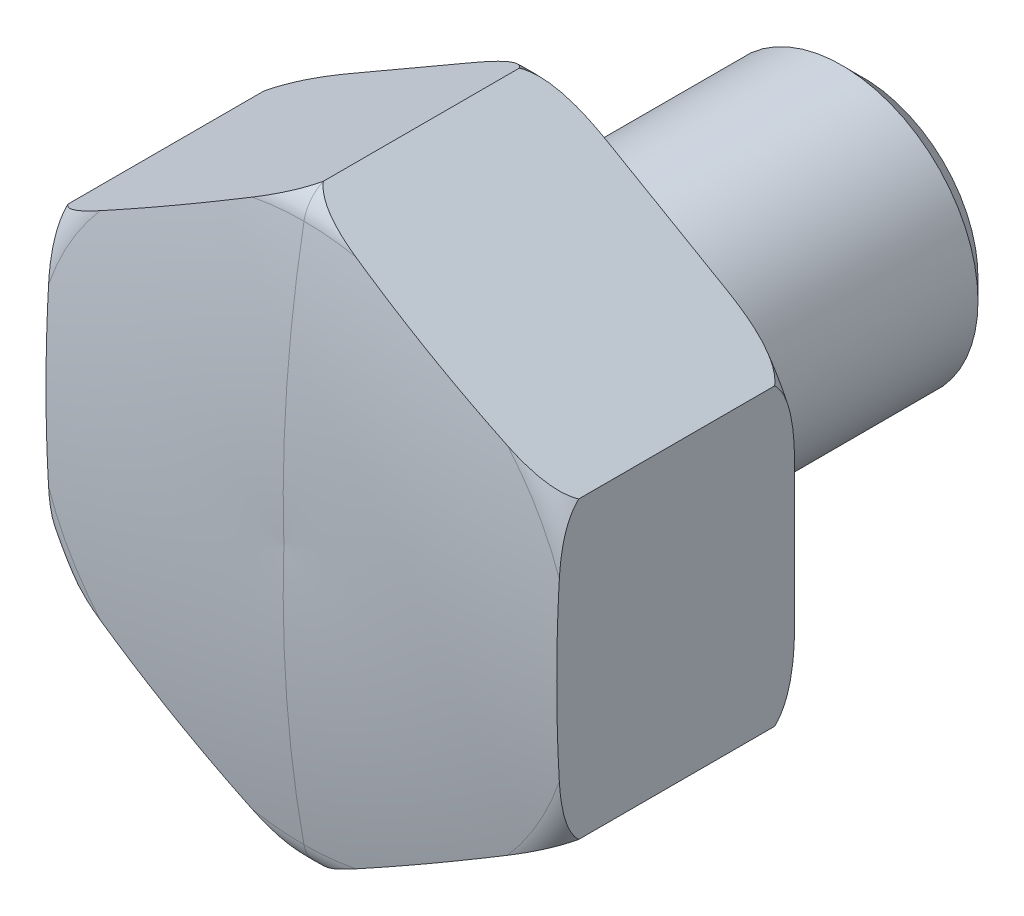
ISO-10303-21;
HEADER;
FILE_DESCRIPTION(('STEP AP214'),'2;1');
FILE_NAME('part.step','',(''),(''),'','','');
FILE_SCHEMA(('AUTOMOTIVE_DESIGN { 1 0 10303 214 1 1 1 1 }'));
ENDSEC;
DATA;
#1=APPLICATION_CONTEXT('core data for automotive mechanical design processes');
#2=APPLICATION_PROTOCOL_DEFINITION('international standard','automotive_design',2000,#1);
#3=PRODUCT_CONTEXT('',#1,'mechanical');
#4=PRODUCT('Part','Part','',(#3));
#5=PRODUCT_RELATED_PRODUCT_CATEGORY('part','',(#4));
#6=PRODUCT_DEFINITION_FORMATION('','',#4);
#7=PRODUCT_DEFINITION_CONTEXT('part definition',#1,'design');
#8=PRODUCT_DEFINITION('design','',#6,#7);
#9=PRODUCT_DEFINITION_SHAPE('','',#8);
#10=(LENGTH_UNIT() NAMED_UNIT(*) SI_UNIT(.MILLI.,.METRE.));
#11=(NAMED_UNIT(*) PLANE_ANGLE_UNIT() SI_UNIT($,.RADIAN.));
#12=(NAMED_UNIT(*) SI_UNIT($,.STERADIAN.) SOLID_ANGLE_UNIT());
#13=UNCERTAINTY_MEASURE_WITH_UNIT(LENGTH_MEASURE(1.E-05),#10,'distance_accuracy_value','');
#14=(GEOMETRIC_REPRESENTATION_CONTEXT(3) GLOBAL_UNCERTAINTY_ASSIGNED_CONTEXT((#13)) GLOBAL_UNIT_ASSIGNED_CONTEXT((#10,
#11,#12)) REPRESENTATION_CONTEXT('',''));
#15=CARTESIAN_POINT('',(0.,0.,0.));
#16=DIRECTION('',(0.,0.,1.));
#17=DIRECTION('',(1.,0.,0.));
#18=AXIS2_PLACEMENT_3D('',#15,#16,#17);
#19=CARTESIAN_POINT('',(6.77299999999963,-6.85427810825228,-19.0000000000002));
#20=DIRECTION('',(0.,0.,-1.));
#21=DIRECTION('',(-1.,0.,0.));
#22=AXIS2_PLACEMENT_3D('',#19,#20,#21);
#23=PLANE('',#22);
#24=CARTESIAN_POINT('',(-3.68300210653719E-13,2.86426724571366E-13,-19.));
#25=DIRECTION('',(0.,0.,1.));
#26=DIRECTION('',(0.,-1.,0.));
#27=AXIS2_PLACEMENT_3D('',#24,#25,#26);
#28=CIRCLE('',#27,6.773);
#29=CARTESIAN_POINT('',(-3.68300210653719E-13,-6.77299999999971,-19.0000000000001));
#30=VERTEX_POINT('',#29);
#31=EDGE_CURVE('E17',#30,#30,#28,.T.);
#32=ORIENTED_EDGE('',*,*,#31,.F.);
#33=EDGE_LOOP('',(#32));
#34=FACE_BOUND('',#33,.T.);
#35=ADVANCED_FACE('F14',(#34),#23,.T.);
#36=CARTESIAN_POINT('',(-3.68300210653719E-13,2.86426724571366E-13,-19.));
#37=DIRECTION('',(0.,0.,1.));
#38=DIRECTION('',(0.,-1.,0.));
#39=AXIS2_PLACEMENT_3D('',#36,#37,#38);
#40=CONICAL_SURFACE('',#39,6.773,0.785398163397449);
#41=ORIENTED_EDGE('',*,*,#31,.T.);
#42=EDGE_LOOP('',(#41));
#43=FACE_BOUND('',#42,.T.);
#44=CARTESIAN_POINT('',(-3.44515770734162E-13,2.67929588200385E-13,-17.7730000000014));
#45=DIRECTION('',(0.,0.,1.));
#46=DIRECTION('',(1.,0.,0.));
#47=AXIS2_PLACEMENT_3D('',#44,#45,#46);
#48=CIRCLE('',#47,8.);
#49=CARTESIAN_POINT('',(7.99999999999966,2.67929588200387E-13,-17.7730000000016));
#50=VERTEX_POINT('',#49);
#51=EDGE_CURVE('E163',#50,#50,#48,.T.);
#52=ORIENTED_EDGE('',*,*,#51,.F.);
#53=EDGE_LOOP('',(#52));
#54=FACE_BOUND('',#53,.T.);
#55=ADVANCED_FACE('F841',(#43,#54),#40,.T.);
#56=CARTESIAN_POINT('',(2.29722731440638E-13,-1.78655150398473E-13,11.8510165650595));
#57=DIRECTION('',(0.,0.,1.));
#58=DIRECTION('',(0.,-1.,0.));
#59=AXIS2_PLACEMENT_3D('',#56,#57,#58);
#60=TOROIDAL_SURFACE('',#59,15.4999999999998,2.);
#61=CARTESIAN_POINT('',(3.0406486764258,-15.5649887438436,13.8184948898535));
#62=CARTESIAN_POINT('',(2.93866607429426,-15.6238684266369,13.8115016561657));
#63=CARTESIAN_POINT('',(2.83673781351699,-15.6827167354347,13.8031704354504));
#64=CARTESIAN_POINT('',(2.63273011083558,-15.8005006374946,13.7832407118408));
#65=CARTESIAN_POINT('',(2.53065158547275,-15.8594357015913,13.7716298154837));
#66=CARTESIAN_POINT('',(2.32671704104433,-15.9771773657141,13.7445745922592));
#67=CARTESIAN_POINT('',(2.22486156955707,-16.0359836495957,13.7291246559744));
#68=CARTESIAN_POINT('',(2.01743778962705,-16.1557398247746,13.6929834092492));
#69=CARTESIAN_POINT('',(1.91189438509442,-16.2166753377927,13.6720982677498));
#70=CARTESIAN_POINT('',(1.70189984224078,-16.3379157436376,13.6245885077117));
#71=CARTESIAN_POINT('',(1.59744754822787,-16.3982213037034,13.5979707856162));
#72=CARTESIAN_POINT('',(1.3900919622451,-16.5179381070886,13.5379400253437));
#73=CARTESIAN_POINT('',(1.28718730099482,-16.5773501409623,13.5045334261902));
#74=CARTESIAN_POINT('',(1.11404975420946,-16.6773111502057,13.4408035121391));
#75=CARTESIAN_POINT('',(1.04324787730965,-16.7181886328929,13.4125449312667));
#76=CARTESIAN_POINT('',(0.9030983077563,-16.7991040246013,13.3514767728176));
#77=CARTESIAN_POINT('',(0.833750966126,-16.8391417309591,13.3186661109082));
#78=CARTESIAN_POINT('',(0.697904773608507,-16.9175725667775,13.2482993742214));
#79=CARTESIAN_POINT('',(0.631381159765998,-16.955979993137,13.2108077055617));
#80=CARTESIAN_POINT('',(0.501030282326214,-17.0312381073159,13.1300687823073));
#81=CARTESIAN_POINT('',(0.437201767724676,-17.0680895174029,13.0868242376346));
#82=CARTESIAN_POINT('',(0.307127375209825,-17.143188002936,12.9891652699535));
#83=CARTESIAN_POINT('',(0.241253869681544,-17.1812200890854,12.9340725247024));
#84=CARTESIAN_POINT('',(0.146976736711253,-17.2356510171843,12.844328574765));
#85=CARTESIAN_POINT('',(0.116158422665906,-17.2534439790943,12.8130483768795));
#86=CARTESIAN_POINT('',(0.0564950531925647,-17.2878906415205,12.7479879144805));
#87=CARTESIAN_POINT('',(0.0276527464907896,-17.3045427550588,12.7142042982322));
#88=CARTESIAN_POINT('',(2.42209895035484E-13,-17.3205080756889,12.6791170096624));
#89=B_SPLINE_CURVE_WITH_KNOTS('',3,(#61,#62,#63,#64,#65,#66,#67,#68,#69,#70,#71,#72,#73,#74,#75,
#76,#77,#78,#79,#80,#81,#82,#83,#84,#85,#86,#87,#88),.UNSPECIFIED.,.F.,.F.,(4,2,2,2,2,2,2,2,2,2,
2,2,2,4),(0.,0.353918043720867,0.709191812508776,1.06498777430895,1.43581268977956,
1.80619396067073,2.17622556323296,2.43561656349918,2.695069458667,2.95128097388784,
3.2073722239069,3.48846542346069,3.63049608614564,3.77272046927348),.UNSPECIFIED.);
#90=CARTESIAN_POINT('',(3.04064867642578,-15.5649887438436,13.8184948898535));
#91=VERTEX_POINT('',#90);
#92=CARTESIAN_POINT('',(2.45774813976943E-13,-17.3205080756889,12.6791170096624));
#93=VERTEX_POINT('',#92);
#94=EDGE_CURVE('E548',#91,#93,#89,.T.);
#95=ORIENTED_EDGE('',*,*,#94,.F.);
#96=CARTESIAN_POINT('',(2.6786076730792E-13,-2.08315064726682E-13,13.8184948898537));
#97=DIRECTION('',(0.,0.,1.));
#98=DIRECTION('',(0.,-1.,0.));
#99=AXIS2_PLACEMENT_3D('',#96,#97,#98);
#100=CIRCLE('',#99,15.8592061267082);
#101=CARTESIAN_POINT('',(2.6786076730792E-13,-15.8592061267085,13.8184948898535));
#102=VERTEX_POINT('',#101);
#103=EDGE_CURVE('E1005',#102,#91,#100,.T.);
#104=ORIENTED_EDGE('',*,*,#103,.F.);
#105=CARTESIAN_POINT('',(2.29722731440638E-13,-15.5,11.8510165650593));
#106=DIRECTION('',(1.,0.,0.));
#107=DIRECTION('',(0.,1.,0.));
#108=AXIS2_PLACEMENT_3D('',#105,#106,#107);
#109=CIRCLE('',#108,2.);
#110=EDGE_CURVE('E334',#93,#102,#109,.F.);
#111=ORIENTED_EDGE('',*,*,#110,.F.);
#112=EDGE_LOOP('',(#95,#104,#111));
#113=FACE_BOUND('',#112,.T.);
#114=ADVANCED_FACE('F340',(#113),#60,.T.);
#115=CARTESIAN_POINT('',(2.29722731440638E-13,-1.78655150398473E-13,11.8510165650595));
#116=DIRECTION('',(0.,0.,1.));
#117=DIRECTION('',(0.,-1.,0.));
#118=AXIS2_PLACEMENT_3D('',#115,#116,#117);
#119=TOROIDAL_SURFACE('',#118,15.4999999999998,2.);
#120=CARTESIAN_POINT('',(2.6786076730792E-13,-2.08315064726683E-13,13.8184948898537));
#121=DIRECTION('',(0.,0.,1.));
#122=DIRECTION('',(0.,-1.,0.));
#123=AXIS2_PLACEMENT_3D('',#120,#121,#122);
#124=CIRCLE('',#123,15.8592061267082);
#125=CARTESIAN_POINT('',(-3.04064867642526,-15.5649887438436,13.8184948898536));
#126=VERTEX_POINT('',#125);
#127=EDGE_CURVE('E219',#126,#102,#124,.T.);
#128=ORIENTED_EDGE('',*,*,#127,.F.);
#129=CARTESIAN_POINT('',(2.4574912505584E-13,-17.3205080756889,12.6791170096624));
#130=CARTESIAN_POINT('',(-0.0339364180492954,-17.3009148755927,12.7221630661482));
#131=CARTESIAN_POINT('',(-0.0696498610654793,-17.2802957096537,12.7632507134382));
#132=CARTESIAN_POINT('',(-0.143787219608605,-17.2374924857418,12.8415496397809));
#133=CARTESIAN_POINT('',(-0.18219533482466,-17.2153175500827,12.8787807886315));
#134=CARTESIAN_POINT('',(-0.261210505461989,-17.1696981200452,12.9498238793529));
#135=CARTESIAN_POINT('',(-0.30181465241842,-17.1462553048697,12.983640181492));
#136=CARTESIAN_POINT('',(-0.38408041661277,-17.098759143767,13.0476116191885));
#137=CARTESIAN_POINT('',(-0.425710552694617,-17.0747239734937,13.0778210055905));
#138=CARTESIAN_POINT('',(-0.510414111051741,-17.0258203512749,13.1355456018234));
#139=CARTESIAN_POINT('',(-0.553489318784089,-17.0009508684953,13.1630573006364));
#140=CARTESIAN_POINT('',(-0.640789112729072,-16.9505483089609,13.2155889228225));
#141=CARTESIAN_POINT('',(-0.68501433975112,-16.9250148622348,13.2406074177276));
#142=CARTESIAN_POINT('',(-0.800913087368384,-16.8581006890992,13.3025270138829));
#143=CARTESIAN_POINT('',(-0.873294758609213,-16.8163111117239,13.3376647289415));
#144=CARTESIAN_POINT('',(-1.01972737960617,-16.7317681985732,13.402868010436));
#145=CARTESIAN_POINT('',(-1.0937783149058,-16.6890148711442,13.4329336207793));
#146=CARTESIAN_POINT('',(-1.24312101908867,-16.6027918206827,13.488638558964));
#147=CARTESIAN_POINT('',(-1.31841295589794,-16.5593220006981,13.5142772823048));
#148=CARTESIAN_POINT('',(-1.47084955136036,-16.4713126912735,13.5619609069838));
#149=CARTESIAN_POINT('',(-1.54800560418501,-16.4267666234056,13.5839568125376));
#150=CARTESIAN_POINT('',(-1.70298208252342,-16.3372909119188,13.6244368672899));
#151=CARTESIAN_POINT('',(-1.7808023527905,-16.2923613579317,13.642921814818));
#152=CARTESIAN_POINT('',(-1.93693483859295,-16.2022182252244,13.6767959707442));
#153=CARTESIAN_POINT('',(-2.01524701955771,-16.1570046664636,13.6921853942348));
#154=CARTESIAN_POINT('',(-2.25192222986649,-16.0203601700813,13.734480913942));
#155=CARTESIAN_POINT('',(-2.41085017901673,-15.9286030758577,13.7572199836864));
#156=CARTESIAN_POINT('',(-2.64840414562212,-15.791451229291,13.7847160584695));
#157=CARTESIAN_POINT('',(-2.72677355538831,-15.7462046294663,13.7927375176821));
#158=CARTESIAN_POINT('',(-2.88363021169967,-15.6556433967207,13.8069379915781));
#159=CARTESIAN_POINT('',(-2.96211744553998,-15.610328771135,13.8131171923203));
#160=CARTESIAN_POINT('',(-3.04064867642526,-15.5649887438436,13.8184948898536));
#161=B_SPLINE_CURVE_WITH_KNOTS('',3,(#129,#130,#131,#132,#133,#134,#135,#136,#137,#138,#139,
#140,#141,#142,#143,#144,#145,#146,#147,#148,#149,#150,#151,#152,#153,#154,#155,#156,#157,#158,
#159,#160),.UNSPECIFIED.,.F.,.F.,(4,2,2,2,2,2,2,2,2,2,2,2,2,2,2,4),(0.,0.174467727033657,
0.347986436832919,0.521280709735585,0.691504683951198,0.86194734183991,1.032487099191,
1.30427227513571,1.57605509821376,1.847875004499,2.12309695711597,2.39825625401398,
2.67339642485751,3.22783009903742,3.50036300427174,3.77286837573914),.UNSPECIFIED.);
#162=EDGE_CURVE('E345',#93,#126,#161,.T.);
#163=ORIENTED_EDGE('',*,*,#162,.F.);
#164=ORIENTED_EDGE('',*,*,#110,.T.);
#165=EDGE_LOOP('',(#128,#163,#164));
#166=FACE_BOUND('',#165,.T.);
#167=ADVANCED_FACE('F336',(#166),#119,.T.);
#168=CARTESIAN_POINT('',(2.29722731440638E-13,-1.78655150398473E-13,11.8510165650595));
#169=DIRECTION('',(0.,0.,1.));
#170=DIRECTION('',(0.,-1.,0.));
#171=AXIS2_PLACEMENT_3D('',#168,#169,#170);
#172=TOROIDAL_SURFACE('',#171,15.4999999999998,2.);
#173=CARTESIAN_POINT('',(2.6786076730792E-13,-2.08315064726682E-13,13.8184948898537));
#174=DIRECTION('',(0.,0.,1.));
#175=DIRECTION('',(0.,-1.,0.));
#176=AXIS2_PLACEMENT_3D('',#173,#174,#175);
#177=CIRCLE('',#176,15.8592061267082);
#178=CARTESIAN_POINT('',(-14.9999999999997,-5.14921537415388,13.8184948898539));
#179=VERTEX_POINT('',#178);
#180=CARTESIAN_POINT('',(-11.9593513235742,-10.4157733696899,13.8184948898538));
#181=VERTEX_POINT('',#180);
#182=EDGE_CURVE('E408',#179,#181,#177,.T.);
#183=ORIENTED_EDGE('',*,*,#182,.F.);
#184=CARTESIAN_POINT('',(-14.9999999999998,-8.66025403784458,12.6791170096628));
#185=CARTESIAN_POINT('',(-14.9999999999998,-8.62106763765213,12.7221630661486));
#186=CARTESIAN_POINT('',(-14.9999999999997,-8.57982930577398,12.7632507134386));
#187=CARTESIAN_POINT('',(-14.9999999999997,-8.49422285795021,12.8415496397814));
#188=CARTESIAN_POINT('',(-14.9999999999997,-8.4498729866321,12.8787807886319));
#189=CARTESIAN_POINT('',(-14.9999999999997,-8.35863412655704,12.9498238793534));
#190=CARTESIAN_POINT('',(-14.9999999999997,-8.31174849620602,12.9836401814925));
#191=CARTESIAN_POINT('',(-14.9999999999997,-8.21675617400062,13.0476116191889));
#192=CARTESIAN_POINT('',(-14.9999999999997,-8.16868583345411,13.0778210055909));
#193=CARTESIAN_POINT('',(-14.9999999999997,-8.0708785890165,13.1355456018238));
#194=CARTESIAN_POINT('',(-14.9999999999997,-8.02113962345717,13.1630573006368));
#195=CARTESIAN_POINT('',(-14.9999999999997,-7.92033450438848,13.2155889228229));
#196=CARTESIAN_POINT('',(-14.9999999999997,-7.86926761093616,13.240607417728));
#197=CARTESIAN_POINT('',(-14.9999999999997,-7.73543926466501,13.3025270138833));
#198=CARTESIAN_POINT('',(-14.9999999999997,-7.65186010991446,13.3376647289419));
#199=CARTESIAN_POINT('',(-14.9999999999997,-7.482774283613,13.4028680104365));
#200=CARTESIAN_POINT('',(-14.9999999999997,-7.39726762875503,13.4329336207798));
#201=CARTESIAN_POINT('',(-14.9999999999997,-7.22482152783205,13.4886385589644));
#202=CARTESIAN_POINT('',(-14.9999999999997,-7.13788188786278,13.5142772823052));
#203=CARTESIAN_POINT('',(-14.9999999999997,-6.96186326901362,13.5619609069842));
#204=CARTESIAN_POINT('',(-14.9999999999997,-6.87277113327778,13.583956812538));
#205=CARTESIAN_POINT('',(-14.9999999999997,-6.6938197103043,13.6244368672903));
#206=CARTESIAN_POINT('',(-14.9999999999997,-6.60396060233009,13.6429218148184));
#207=CARTESIAN_POINT('',(-14.9999999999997,-6.4236743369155,13.6767959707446));
#208=CARTESIAN_POINT('',(-14.9999999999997,-6.33324721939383,13.6921853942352));
#209=CARTESIAN_POINT('',(-14.9999999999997,-6.05995822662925,13.7344809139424));
#210=CARTESIAN_POINT('',(-14.9999999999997,-5.87644403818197,13.7572199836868));
#211=CARTESIAN_POINT('',(-14.9999999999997,-5.6021403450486,13.7847160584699));
#212=CARTESIAN_POINT('',(-14.9999999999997,-5.51164714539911,13.7927375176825));
#213=CARTESIAN_POINT('',(-14.9999999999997,-5.33052467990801,13.8069379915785));
#214=CARTESIAN_POINT('',(-14.9999999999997,-5.2398954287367,13.8131171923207));
#215=CARTESIAN_POINT('',(-14.9999999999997,-5.14921537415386,13.818494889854));
#216=B_SPLINE_CURVE_WITH_KNOTS('',3,(#184,#185,#186,#187,#188,#189,#190,#191,#192,#193,#194,
#195,#196,#197,#198,#199,#200,#201,#202,#203,#204,#205,#206,#207,#208,#209,#210,#211,#212,#213,
#214,#215),.UNSPECIFIED.,.F.,.F.,(4,2,2,2,2,2,2,2,2,2,2,2,2,2,2,4),(0.,0.174467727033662,
0.347986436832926,0.521280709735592,0.691504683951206,0.86194734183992,1.03248709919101,
1.30427227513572,1.57605509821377,1.84787500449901,2.12309695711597,2.39825625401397,
2.67339642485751,3.22783009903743,3.50036300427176,3.77286837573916),.UNSPECIFIED.);
#217=CARTESIAN_POINT('',(-14.9999999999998,-8.66025403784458,12.6791170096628));
#218=VERTEX_POINT('',#217);
#219=EDGE_CURVE('E414',#218,#179,#216,.T.);
#220=ORIENTED_EDGE('',*,*,#219,.F.);
#221=CARTESIAN_POINT('',(-11.9593513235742,-10.4157733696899,13.8184948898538));
#222=CARTESIAN_POINT('',(-12.0613339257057,-10.3568936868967,13.8115016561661));
#223=CARTESIAN_POINT('',(-12.163262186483,-10.2980453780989,13.8031704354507));
#224=CARTESIAN_POINT('',(-12.3672698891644,-10.180261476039,13.7832407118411));
#225=CARTESIAN_POINT('',(-12.4693484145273,-10.1213264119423,13.7716298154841));
#226=CARTESIAN_POINT('',(-12.6732829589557,-10.0035847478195,13.7445745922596));
#227=CARTESIAN_POINT('',(-12.775138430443,-9.94477846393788,13.7291246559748));
#228=CARTESIAN_POINT('',(-12.982562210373,-9.82502228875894,13.6929834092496));
#229=CARTESIAN_POINT('',(-13.0881056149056,-9.76408677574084,13.6720982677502));
#230=CARTESIAN_POINT('',(-13.2981001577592,-9.64284636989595,13.6245885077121));
#231=CARTESIAN_POINT('',(-13.4025524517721,-9.58254080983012,13.5979707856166));
#232=CARTESIAN_POINT('',(-13.6099080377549,-9.46282400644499,13.5379400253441));
#233=CARTESIAN_POINT('',(-13.7128126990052,-9.40341197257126,13.5045334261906));
#234=CARTESIAN_POINT('',(-13.8859502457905,-9.3034509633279,13.4408035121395));
#235=CARTESIAN_POINT('',(-13.9567521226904,-9.26257348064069,13.4125449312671));
#236=CARTESIAN_POINT('',(-14.0969016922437,-9.18165808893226,13.3514767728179));
#237=CARTESIAN_POINT('',(-14.166249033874,-9.14162038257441,13.3186661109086));
#238=CARTESIAN_POINT('',(-14.3020952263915,-9.06318954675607,13.2482993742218));
#239=CARTESIAN_POINT('',(-14.368618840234,-9.02478212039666,13.2108077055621));
#240=CARTESIAN_POINT('',(-14.4989697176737,-8.94952400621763,13.1300687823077));
#241=CARTESIAN_POINT('',(-14.5627982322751,-8.91267259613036,13.0868242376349));
#242=CARTESIAN_POINT('',(-14.69287262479,-8.83757411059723,12.9891652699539));
#243=CARTESIAN_POINT('',(-14.7587461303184,-8.79954202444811,12.9340725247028));
#244=CARTESIAN_POINT('',(-14.8530232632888,-8.74511109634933,12.8443285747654));
#245=CARTESIAN_POINT('',(-14.8838415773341,-8.72731813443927,12.8130483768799));
#246=CARTESIAN_POINT('',(-14.9435049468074,-8.69287147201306,12.7479879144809));
#247=CARTESIAN_POINT('',(-14.9723472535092,-8.67621935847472,12.7142042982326));
#248=CARTESIAN_POINT('',(-14.9999999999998,-8.66025403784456,12.6791170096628));
#249=B_SPLINE_CURVE_WITH_KNOTS('',3,(#221,#222,#223,#224,#225,#226,#227,#228,#229,#230,#231,
#232,#233,#234,#235,#236,#237,#238,#239,#240,#241,#242,#243,#244,#245,#246,#247,#248),
.UNSPECIFIED.,.F.,.F.,(4,2,2,2,2,2,2,2,2,2,2,2,2,4),(0.,0.353918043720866,0.709191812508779,
1.06498777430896,1.43581268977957,1.80619396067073,2.17622556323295,2.43561656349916,
2.69506945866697,2.95128097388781,3.20737222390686,3.48846542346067,3.63049608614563,
3.77272046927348),.UNSPECIFIED.);
#250=EDGE_CURVE('E393',#181,#218,#249,.T.);
#251=ORIENTED_EDGE('',*,*,#250,.F.);
#252=EDGE_LOOP('',(#183,#220,#251));
#253=FACE_BOUND('',#252,.T.);
#254=ADVANCED_FACE('F313',(#253),#172,.T.);
#255=CARTESIAN_POINT('',(2.29722731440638E-13,-1.78655150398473E-13,11.8510165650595));
#256=DIRECTION('',(0.,0.,1.));
#257=DIRECTION('',(0.,-1.,0.));
#258=AXIS2_PLACEMENT_3D('',#255,#256,#257);
#259=TOROIDAL_SURFACE('',#258,15.4999999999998,2.);
#260=CARTESIAN_POINT('',(-3.04064867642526,15.5649887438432,13.8184948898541));
#261=CARTESIAN_POINT('',(-2.93866607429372,15.6238684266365,13.8115016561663));
#262=CARTESIAN_POINT('',(-2.83673781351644,15.6827167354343,13.8031704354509));
#263=CARTESIAN_POINT('',(-2.63273011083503,15.8005006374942,13.7832407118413));
#264=CARTESIAN_POINT('',(-2.5306515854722,15.8594357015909,13.7716298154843));
#265=CARTESIAN_POINT('',(-2.32671704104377,15.9771773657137,13.7445745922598));
#266=CARTESIAN_POINT('',(-2.22486156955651,16.0359836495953,13.7291246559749));
#267=CARTESIAN_POINT('',(-2.01743778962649,16.1557398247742,13.6929834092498));
#268=CARTESIAN_POINT('',(-1.91189438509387,16.2166753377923,13.6720982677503));
#269=CARTESIAN_POINT('',(-1.70189984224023,16.3379157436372,13.6245885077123));
#270=CARTESIAN_POINT('',(-1.59744754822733,16.3982213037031,13.5979707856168));
#271=CARTESIAN_POINT('',(-1.39009196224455,16.5179381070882,13.5379400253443));
#272=CARTESIAN_POINT('',(-1.28718730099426,16.5773501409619,13.5045334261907));
#273=CARTESIAN_POINT('',(-1.1140497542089,16.6773111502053,13.4408035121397));
#274=CARTESIAN_POINT('',(-1.04324787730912,16.7181886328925,13.4125449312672));
#275=CARTESIAN_POINT('',(-0.903098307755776,16.7991040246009,13.3514767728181));
#276=CARTESIAN_POINT('',(-0.833750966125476,16.8391417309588,13.3186661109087));
#277=CARTESIAN_POINT('',(-0.697904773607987,16.9175725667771,13.2482993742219));
#278=CARTESIAN_POINT('',(-0.631381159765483,16.9559799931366,13.2108077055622));
#279=CARTESIAN_POINT('',(-0.501030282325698,17.0312381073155,13.1300687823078));
#280=CARTESIAN_POINT('',(-0.437201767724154,17.0680895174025,13.0868242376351));
#281=CARTESIAN_POINT('',(-0.307127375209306,17.1431880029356,12.989165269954));
#282=CARTESIAN_POINT('',(-0.241253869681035,17.181220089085,12.9340725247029));
#283=CARTESIAN_POINT('',(-0.146976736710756,17.2356510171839,12.8443285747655));
#284=CARTESIAN_POINT('',(-0.116158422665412,17.2534439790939,12.81304837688));
#285=CARTESIAN_POINT('',(-0.0564950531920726,17.2878906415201,12.747987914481));
#286=CARTESIAN_POINT('',(-0.0276527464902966,17.3045427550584,12.7142042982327));
#287=CARTESIAN_POINT('',(2.55587815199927E-13,17.3205080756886,12.6791170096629));
#288=B_SPLINE_CURVE_WITH_KNOTS('',3,(#260,#261,#262,#263,#264,#265,#266,#267,#268,#269,#270,
#271,#272,#273,#274,#275,#276,#277,#278,#279,#280,#281,#282,#283,#284,#285,#286,#287),
.UNSPECIFIED.,.F.,.F.,(4,2,2,2,2,2,2,2,2,2,2,2,2,4),(0.,0.353918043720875,0.709191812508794,
1.06498777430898,1.43581268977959,1.80619396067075,2.17622556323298,2.43561656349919,
2.69506945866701,2.95128097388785,3.20737222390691,3.4884654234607,3.63049608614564,
3.77272046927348),.UNSPECIFIED.);
#289=CARTESIAN_POINT('',(-3.04064867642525,15.5649887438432,13.818494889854));
#290=VERTEX_POINT('',#289);
#291=CARTESIAN_POINT('',(2.47901182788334E-13,17.3205080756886,12.6791170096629));
#292=VERTEX_POINT('',#291);
#293=EDGE_CURVE('E298',#290,#292,#288,.T.);
#294=ORIENTED_EDGE('',*,*,#293,.F.);
#295=CARTESIAN_POINT('',(2.6786076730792E-13,-2.08315064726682E-13,13.8184948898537));
#296=DIRECTION('',(0.,0.,1.));
#297=DIRECTION('',(0.,-1.,0.));
#298=AXIS2_PLACEMENT_3D('',#295,#296,#297);
#299=CIRCLE('',#298,15.8592061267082);
#300=CARTESIAN_POINT('',(2.69802959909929E-13,15.8592061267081,13.818494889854));
#301=VERTEX_POINT('',#300);
#302=EDGE_CURVE('E864',#301,#290,#299,.T.);
#303=ORIENTED_EDGE('',*,*,#302,.F.);
#304=CARTESIAN_POINT('',(2.31620933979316E-13,15.5,11.8510165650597));
#305=DIRECTION('',(-1.,0.,0.));
#306=DIRECTION('',(0.,-1.,0.));
#307=AXIS2_PLACEMENT_3D('',#304,#305,#306);
#308=CIRCLE('',#307,2.);
#309=EDGE_CURVE('E215',#292,#301,#308,.F.);
#310=ORIENTED_EDGE('',*,*,#309,.F.);
#311=EDGE_LOOP('',(#294,#303,#310));
#312=FACE_BOUND('',#311,.T.);
#313=ADVANCED_FACE('F308',(#312),#259,.T.);
#314=CARTESIAN_POINT('',(2.29722731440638E-13,-1.78655150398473E-13,11.8510165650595));
#315=DIRECTION('',(0.,0.,1.));
#316=DIRECTION('',(0.,-1.,0.));
#317=AXIS2_PLACEMENT_3D('',#314,#315,#316);
#318=TOROIDAL_SURFACE('',#317,15.4999999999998,2.);
#319=CARTESIAN_POINT('',(-14.9999999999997,5.14921537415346,13.8184948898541));
#320=CARTESIAN_POINT('',(-14.9999999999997,5.26697473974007,13.8115016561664));
#321=CARTESIAN_POINT('',(-14.9999999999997,5.38467135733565,13.803170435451));
#322=CARTESIAN_POINT('',(-14.9999999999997,5.62023916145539,13.7832407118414));
#323=CARTESIAN_POINT('',(-14.9999999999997,5.73810928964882,13.7716298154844));
#324=CARTESIAN_POINT('',(-14.9999999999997,5.97359261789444,13.7445745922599));
#325=CARTESIAN_POINT('',(-14.9999999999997,6.09120518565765,13.729124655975));
#326=CARTESIAN_POINT('',(-14.9999999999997,6.33071753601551,13.6929834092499));
#327=CARTESIAN_POINT('',(-14.9999999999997,6.45258856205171,13.6720982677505));
#328=CARTESIAN_POINT('',(-14.9999999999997,6.69506937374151,13.6245885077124));
#329=CARTESIAN_POINT('',(-14.9999999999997,6.81568049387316,13.5979707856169));
#330=CARTESIAN_POINT('',(-14.9999999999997,7.05511410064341,13.5379400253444));
#331=CARTESIAN_POINT('',(-14.9999999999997,7.17393816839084,13.5045334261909));
#332=CARTESIAN_POINT('',(-14.9999999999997,7.37386018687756,13.4408035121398));
#333=CARTESIAN_POINT('',(-14.9999999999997,7.45561515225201,13.4125449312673));
#334=CARTESIAN_POINT('',(-14.9999999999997,7.61744593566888,13.3514767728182));
#335=CARTESIAN_POINT('',(-14.9999999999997,7.69752134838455,13.3186661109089));
#336=CARTESIAN_POINT('',(-14.9999999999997,7.85438302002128,13.2482993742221));
#337=CARTESIAN_POINT('',(-14.9999999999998,7.93119787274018,13.2108077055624));
#338=CARTESIAN_POINT('',(-14.9999999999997,8.08171410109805,13.130068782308));
#339=CARTESIAN_POINT('',(-14.9999999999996,8.15541692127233,13.0868242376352));
#340=CARTESIAN_POINT('',(-14.9999999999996,8.30561389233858,12.9891652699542));
#341=CARTESIAN_POINT('',(-14.9999999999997,8.3816780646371,12.9340725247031));
#342=CARTESIAN_POINT('',(-14.9999999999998,8.49053992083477,12.8443285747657));
#343=CARTESIAN_POINT('',(-14.9999999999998,8.52612584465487,12.8130483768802));
#344=CARTESIAN_POINT('',(-14.9999999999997,8.59501916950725,12.7479879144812));
#345=CARTESIAN_POINT('',(-14.9999999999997,8.62832339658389,12.7142042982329));
#346=CARTESIAN_POINT('',(-14.9999999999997,8.66025403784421,12.6791170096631));
#347=B_SPLINE_CURVE_WITH_KNOTS('',3,(#319,#320,#321,#322,#323,#324,#325,#326,#327,#328,#329,
#330,#331,#332,#333,#334,#335,#336,#337,#338,#339,#340,#341,#342,#343,#344,#345,#346),
.UNSPECIFIED.,.F.,.F.,(4,2,2,2,2,2,2,2,2,2,2,2,2,4),(0.,0.353918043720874,0.709191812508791,
1.06498777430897,1.43581268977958,1.80619396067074,2.17622556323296,2.43561656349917,
2.69506945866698,2.95128097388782,3.20737222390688,3.48846542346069,3.63049608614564,
3.77272046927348),.UNSPECIFIED.);
#348=CARTESIAN_POINT('',(-14.9999999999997,5.14921537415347,13.8184948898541));
#349=VERTEX_POINT('',#348);
#350=CARTESIAN_POINT('',(-14.9999999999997,8.66025403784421,12.6791170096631));
#351=VERTEX_POINT('',#350);
#352=EDGE_CURVE('E416',#349,#351,#347,.T.);
#353=ORIENTED_EDGE('',*,*,#352,.F.);
#354=CARTESIAN_POINT('',(2.6786076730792E-13,-2.08315064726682E-13,13.8184948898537));
#355=DIRECTION('',(0.,0.,1.));
#356=DIRECTION('',(0.,-1.,0.));
#357=AXIS2_PLACEMENT_3D('',#354,#355,#356);
#358=CIRCLE('',#357,15.8592061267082);
#359=CARTESIAN_POINT('',(-11.9593513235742,10.4157733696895,13.8184948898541));
#360=VERTEX_POINT('',#359);
#361=EDGE_CURVE('E412',#360,#349,#358,.T.);
#362=ORIENTED_EDGE('',*,*,#361,.F.);
#363=CARTESIAN_POINT('',(-14.9999999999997,8.66025403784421,12.6791170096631));
#364=CARTESIAN_POINT('',(-14.9660635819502,8.67984723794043,12.7221630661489));
#365=CARTESIAN_POINT('',(-14.930350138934,8.70046640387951,12.7632507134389));
#366=CARTESIAN_POINT('',(-14.8562127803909,8.74326962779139,12.8415496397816));
#367=CARTESIAN_POINT('',(-14.8178046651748,8.76544456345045,12.8787807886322));
#368=CARTESIAN_POINT('',(-14.7387894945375,8.81106399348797,12.9498238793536));
#369=CARTESIAN_POINT('',(-14.6981853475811,8.83450680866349,12.9836401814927));
#370=CARTESIAN_POINT('',(-14.6159195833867,8.88200296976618,13.0476116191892));
#371=CARTESIAN_POINT('',(-14.5742894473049,8.90603814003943,13.0778210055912));
#372=CARTESIAN_POINT('',(-14.4895858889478,8.95494176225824,13.1355456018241));
#373=CARTESIAN_POINT('',(-14.4465106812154,8.97981124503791,13.1630573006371));
#374=CARTESIAN_POINT('',(-14.3592108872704,9.03021380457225,13.2155889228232));
#375=CARTESIAN_POINT('',(-14.3149856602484,9.0557472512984,13.2406074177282));
#376=CARTESIAN_POINT('',(-14.1990869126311,9.12266142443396,13.3025270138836));
#377=CARTESIAN_POINT('',(-14.1267052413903,9.16445100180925,13.3376647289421));
#378=CARTESIAN_POINT('',(-13.9802726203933,9.24899391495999,13.4028680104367));
#379=CARTESIAN_POINT('',(-13.9062216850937,9.29174724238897,13.43293362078));
#380=CARTESIAN_POINT('',(-13.7568789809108,9.37797029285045,13.4886385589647));
#381=CARTESIAN_POINT('',(-13.6815870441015,9.42144011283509,13.5142772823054));
#382=CARTESIAN_POINT('',(-13.5291504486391,9.50944942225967,13.5619609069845));
#383=CARTESIAN_POINT('',(-13.4519943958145,9.55399549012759,13.5839568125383));
#384=CARTESIAN_POINT('',(-13.2970179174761,9.64347120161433,13.6244368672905));
#385=CARTESIAN_POINT('',(-13.219197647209,9.68840075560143,13.6429218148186));
#386=CARTESIAN_POINT('',(-13.0630651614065,9.77854388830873,13.6767959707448));
#387=CARTESIAN_POINT('',(-12.9847529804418,9.82375744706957,13.6921853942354));
#388=CARTESIAN_POINT('',(-12.748077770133,9.96040194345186,13.7344809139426));
#389=CARTESIAN_POINT('',(-12.5891498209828,10.0521590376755,13.757219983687));
#390=CARTESIAN_POINT('',(-12.3515958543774,10.1893108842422,13.7847160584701));
#391=CARTESIAN_POINT('',(-12.2732264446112,10.2345574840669,13.7927375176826));
#392=CARTESIAN_POINT('',(-12.1163697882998,10.3251187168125,13.8069379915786));
#393=CARTESIAN_POINT('',(-12.0378825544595,10.3704333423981,13.8131171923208));
#394=CARTESIAN_POINT('',(-11.9593513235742,10.4157733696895,13.8184948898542));
#395=B_SPLINE_CURVE_WITH_KNOTS('',3,(#363,#364,#365,#366,#367,#368,#369,#370,#371,#372,#373,
#374,#375,#376,#377,#378,#379,#380,#381,#382,#383,#384,#385,#386,#387,#388,#389,#390,#391,#392,
#393,#394),.UNSPECIFIED.,.F.,.F.,(4,2,2,2,2,2,2,2,2,2,2,2,2,2,2,4),(0.,0.174467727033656,
0.347986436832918,0.52128070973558,0.691504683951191,0.861947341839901,1.03248709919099,
1.3042722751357,1.57605509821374,1.84787500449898,2.12309695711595,2.39825625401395,
2.67339642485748,3.22783009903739,3.50036300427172,3.77286837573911),.UNSPECIFIED.);
#396=EDGE_CURVE('E262',#351,#360,#395,.T.);
#397=ORIENTED_EDGE('',*,*,#396,.F.);
#398=EDGE_LOOP('',(#353,#362,#397));
#399=FACE_BOUND('',#398,.T.);
#400=ADVANCED_FACE('F234',(#399),#318,.T.);
#401=CARTESIAN_POINT('',(-1.1623155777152E-12,-2.38897637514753,-59.9619422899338));
#402=DIRECTION('',(1.,0.,0.));
#403=DIRECTION('',(0.,0.0318530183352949,0.99949256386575));
#404=AXIS2_PLACEMENT_3D('',#401,#402,#403);
#405=CIRCLE('',#404,75.0000000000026);
#406=TRIMMED_CURVE('',#405,(PARAMETER_VALUE(0.)),(PARAMETER_VALUE(3.20530946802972)),.T.,.PARAMETER.);
#407=CARTESIAN_POINT('',(-1.1623155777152E-12,9.03931722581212E-13,-59.9619422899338));
#408=DIRECTION('',(0.,0.,1.));
#409=AXIS1_PLACEMENT('',#407,#408);
#410=SURFACE_OF_REVOLUTION('',#406,#409);
#411=ORIENTED_EDGE('',*,*,#127,.T.);
#412=CARTESIAN_POINT('',(-1.1623155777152E-12,-2.38897637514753,-59.9619422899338));
#413=DIRECTION('',(1.,0.,0.));
#414=DIRECTION('',(0.,0.0318530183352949,0.99949256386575));
#415=AXIS2_PLACEMENT_3D('',#412,#413,#414);
#416=CIRCLE('',#415,75.0000000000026);
#417=CARTESIAN_POINT('',(2.90763324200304E-13,-2.25692680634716E-13,15.));
#418=VERTEX_POINT('',#417);
#419=EDGE_CURVE('E1007',#418,#102,#416,.T.);
#420=ORIENTED_EDGE('',*,*,#419,.F.);
#421=CARTESIAN_POINT('',(-1.16202301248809E-12,2.38897637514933,-59.9619422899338));
#422=DIRECTION('',(-1.,0.,0.));
#423=DIRECTION('',(0.,-0.0318530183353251,0.99949256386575));
#424=AXIS2_PLACEMENT_3D('',#421,#422,#423);
#425=CIRCLE('',#424,75.0000000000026);
#426=EDGE_CURVE('E218',#301,#418,#425,.F.);
#427=ORIENTED_EDGE('',*,*,#426,.F.);
#428=ORIENTED_EDGE('',*,*,#302,.T.);
#429=CARTESIAN_POINT('',(-11.9593513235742,10.4157733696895,13.8184948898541));
#430=CARTESIAN_POINT('',(-11.6621616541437,10.5873559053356,13.8388360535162));
#431=CARTESIAN_POINT('',(-11.3648660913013,10.7589995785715,13.8571063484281));
#432=CARTESIAN_POINT('',(-10.7702730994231,11.1022880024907,13.8895291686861));
#433=CARTESIAN_POINT('',(-10.4729757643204,11.2739326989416,13.9036839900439));
#434=CARTESIAN_POINT('',(-9.87838052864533,11.6172224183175,13.9279174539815));
#435=CARTESIAN_POINT('',(-9.58108267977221,11.7888674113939,13.9379977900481));
#436=CARTESIAN_POINT('',(-8.9864870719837,12.1321573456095,13.9541126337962));
#437=CARTESIAN_POINT('',(-8.68918933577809,12.3038022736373,13.9601482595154));
#438=CARTESIAN_POINT('',(-8.09459439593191,12.6470918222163,13.9681930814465));
#439=CARTESIAN_POINT('',(-7.79729719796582,12.8187364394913,13.970202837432));
#440=CARTESIAN_POINT('',(-7.20270280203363,13.1620256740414,13.970202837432));
#441=CARTESIAN_POINT('',(-6.90540560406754,13.3336702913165,13.9681930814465));
#442=CARTESIAN_POINT('',(-6.31081066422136,13.6769598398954,13.9601482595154));
#443=CARTESIAN_POINT('',(-6.01351292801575,13.8486047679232,13.9541126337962));
#444=CARTESIAN_POINT('',(-5.41891732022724,14.1918947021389,13.9379977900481));
#445=CARTESIAN_POINT('',(-5.12161947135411,14.3635396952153,13.9279174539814));
#446=CARTESIAN_POINT('',(-4.52702423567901,14.7068294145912,13.9036839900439));
#447=CARTESIAN_POINT('',(-4.22972690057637,14.878474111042,13.889529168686));
#448=CARTESIAN_POINT('',(-3.63513390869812,15.2217625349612,13.857106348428));
#449=CARTESIAN_POINT('',(-3.33783834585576,15.3934062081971,13.8388360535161));
#450=CARTESIAN_POINT('',(-3.04064867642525,15.5649887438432,13.818494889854));
#451=B_SPLINE_CURVE_WITH_KNOTS('',3,(#429,#430,#431,#432,#433,#434,#435,#436,#437,#438,#439,
#440,#441,#442,#443,#444,#445,#446,#447,#448,#449,#450),.UNSPECIFIED.,.F.,.F.,(4,2,2,2,2,2,2,2,
2,2,4),(0.,1.03129525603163,2.06201404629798,3.09230399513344,4.12230903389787,5.15217084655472,
6.18203265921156,7.212037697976,8.24232764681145,9.27304643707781,10.3043416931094),.UNSPECIFIED.);
#452=EDGE_CURVE('E252',#360,#290,#451,.T.);
#453=ORIENTED_EDGE('',*,*,#452,.F.);
#454=ORIENTED_EDGE('',*,*,#361,.T.);
#455=CARTESIAN_POINT('',(-14.9999999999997,-5.14921537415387,13.818494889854));
#456=CARTESIAN_POINT('',(-14.9999999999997,-4.80605030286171,13.8388360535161));
#457=CARTESIAN_POINT('',(-14.9999999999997,-4.46276295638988,13.8571063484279));
#458=CARTESIAN_POINT('',(-14.9999999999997,-3.77618610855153,13.889529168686));
#459=CARTESIAN_POINT('',(-14.9999999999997,-3.43289671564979,13.9036839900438));
#460=CARTESIAN_POINT('',(-14.9999999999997,-2.74631727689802,13.9279174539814));
#461=CARTESIAN_POINT('',(-14.9999999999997,-2.40302729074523,13.937997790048));
#462=CARTESIAN_POINT('',(-14.9999999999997,-1.7164474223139,13.9541126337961));
#463=CARTESIAN_POINT('',(-14.9999999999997,-1.37315756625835,13.9601482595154));
#464=CARTESIAN_POINT('',(-14.9999999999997,-0.686578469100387,13.9681930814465));
#465=CARTESIAN_POINT('',(-14.9999999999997,-0.343289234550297,13.9702028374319));
#466=CARTESIAN_POINT('',(-14.9999999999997,0.343289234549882,13.9702028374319));
#467=CARTESIAN_POINT('',(-14.9999999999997,0.686578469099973,13.9681930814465));
#468=CARTESIAN_POINT('',(-14.9999999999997,1.37315756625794,13.9601482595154));
#469=CARTESIAN_POINT('',(-14.9999999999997,1.71644742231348,13.9541126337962));
#470=CARTESIAN_POINT('',(-14.9999999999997,2.40302729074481,13.9379977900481));
#471=CARTESIAN_POINT('',(-14.9999999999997,2.7463172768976,13.9279174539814));
#472=CARTESIAN_POINT('',(-14.9999999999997,3.43289671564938,13.9036839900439));
#473=CARTESIAN_POINT('',(-14.9999999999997,3.77618610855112,13.8895291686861));
#474=CARTESIAN_POINT('',(-14.9999999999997,4.46276295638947,13.8571063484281));
#475=CARTESIAN_POINT('',(-14.9999999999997,4.8060503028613,13.8388360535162));
#476=CARTESIAN_POINT('',(-14.9999999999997,5.14921537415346,13.8184948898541));
#477=B_SPLINE_CURVE_WITH_KNOTS('',3,(#455,#456,#457,#458,#459,#460,#461,#462,#463,#464,#465,
#466,#467,#468,#469,#470,#471,#472,#473,#474,#475,#476),.UNSPECIFIED.,.F.,.F.,(4,2,2,2,2,2,2,2,
2,2,4),(0.,1.03129525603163,2.06201404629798,3.09230399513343,4.12230903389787,5.15217084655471,
6.18203265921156,7.21203769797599,8.24232764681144,9.2730464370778,10.3043416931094),.UNSPECIFIED.);
#478=EDGE_CURVE('E242',#179,#349,#477,.T.);
#479=ORIENTED_EDGE('',*,*,#478,.F.);
#480=ORIENTED_EDGE('',*,*,#182,.T.);
#481=CARTESIAN_POINT('',(-3.04064867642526,-15.5649887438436,13.8184948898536));
#482=CARTESIAN_POINT('',(-3.33783834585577,-15.3934062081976,13.8388360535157));
#483=CARTESIAN_POINT('',(-3.63513390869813,-15.2217625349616,13.8571063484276));
#484=CARTESIAN_POINT('',(-4.22972690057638,-14.8784741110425,13.8895291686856));
#485=CARTESIAN_POINT('',(-4.52702423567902,-14.7068294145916,13.9036839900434));
#486=CARTESIAN_POINT('',(-5.12161947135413,-14.3635396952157,13.927917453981));
#487=CARTESIAN_POINT('',(-5.41891732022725,-14.1918947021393,13.9379977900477));
#488=CARTESIAN_POINT('',(-6.01351292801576,-13.8486047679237,13.9541126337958));
#489=CARTESIAN_POINT('',(-6.31081066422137,-13.6769598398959,13.960148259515));
#490=CARTESIAN_POINT('',(-6.90540560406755,-13.3336702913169,13.9681930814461));
#491=CARTESIAN_POINT('',(-7.20270280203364,-13.1620256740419,13.9702028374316));
#492=CARTESIAN_POINT('',(-7.79729719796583,-12.8187364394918,13.9702028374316));
#493=CARTESIAN_POINT('',(-8.09459439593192,-12.6470918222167,13.9681930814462));
#494=CARTESIAN_POINT('',(-8.6891893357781,-12.3038022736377,13.9601482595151));
#495=CARTESIAN_POINT('',(-8.98648707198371,-12.13215734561,13.9541126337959));
#496=CARTESIAN_POINT('',(-9.58108267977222,-11.7888674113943,13.9379977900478));
#497=CARTESIAN_POINT('',(-9.87838052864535,-11.6172224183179,13.9279174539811));
#498=CARTESIAN_POINT('',(-10.4729757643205,-11.273932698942,13.9036839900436));
#499=CARTESIAN_POINT('',(-10.7702730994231,-11.1022880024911,13.8895291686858));
#500=CARTESIAN_POINT('',(-11.3648660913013,-10.758999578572,13.8571063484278));
#501=CARTESIAN_POINT('',(-11.6621616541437,-10.587355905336,13.8388360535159));
#502=CARTESIAN_POINT('',(-11.9593513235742,-10.4157733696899,13.8184948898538));
#503=B_SPLINE_CURVE_WITH_KNOTS('',3,(#481,#482,#483,#484,#485,#486,#487,#488,#489,#490,#491,
#492,#493,#494,#495,#496,#497,#498,#499,#500,#501,#502),.UNSPECIFIED.,.F.,.F.,(4,2,2,2,2,2,2,2,
2,2,4),(0.,1.03129525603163,2.06201404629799,3.09230399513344,4.12230903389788,5.15217084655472,
6.18203265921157,7.21203769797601,8.24232764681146,9.27304643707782,10.3043416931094),.UNSPECIFIED.);
#504=EDGE_CURVE('E353',#126,#181,#503,.T.);
#505=ORIENTED_EDGE('',*,*,#504,.F.);
#506=EDGE_LOOP('',(#411,#420,#427,#428,#453,#454,#479,#480,#505));
#507=FACE_BOUND('',#506,.T.);
#508=ADVANCED_FACE('F230',(#507),#410,.F.);
#509=CARTESIAN_POINT('',(2.29722731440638E-13,-1.78655150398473E-13,11.8510165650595));
#510=DIRECTION('',(0.,0.,1.));
#511=DIRECTION('',(0.,-1.,0.));
#512=AXIS2_PLACEMENT_3D('',#509,#510,#511);
#513=TOROIDAL_SURFACE('',#512,15.4999999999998,2.);
#514=CARTESIAN_POINT('',(2.6786076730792E-13,-2.08315064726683E-13,13.8184948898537));
#515=DIRECTION('',(0.,0.,1.));
#516=DIRECTION('',(0.,-1.,0.));
#517=AXIS2_PLACEMENT_3D('',#514,#515,#516);
#518=CIRCLE('',#517,15.8592061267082);
#519=CARTESIAN_POINT('',(3.04064867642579,15.5649887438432,13.8184948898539));
#520=VERTEX_POINT('',#519);
#521=EDGE_CURVE('E996',#520,#301,#518,.T.);
#522=ORIENTED_EDGE('',*,*,#521,.F.);
#523=CARTESIAN_POINT('',(2.48186797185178E-13,17.3205080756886,12.6791170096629));
#524=CARTESIAN_POINT('',(0.0339364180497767,17.3009148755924,12.7221630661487));
#525=CARTESIAN_POINT('',(0.0696498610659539,17.2802957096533,12.7632507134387));
#526=CARTESIAN_POINT('',(0.143787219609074,17.2374924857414,12.8415496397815));
#527=CARTESIAN_POINT('',(0.18219533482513,17.2153175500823,12.878780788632));
#528=CARTESIAN_POINT('',(0.261210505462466,17.1696981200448,12.9498238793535));
#529=CARTESIAN_POINT('',(0.301814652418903,17.1462553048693,12.9836401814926));
#530=CARTESIAN_POINT('',(0.384080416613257,17.0987591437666,13.047611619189));
#531=CARTESIAN_POINT('',(0.425710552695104,17.0747239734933,13.077821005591));
#532=CARTESIAN_POINT('',(0.510414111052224,17.0258203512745,13.1355456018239));
#533=CARTESIAN_POINT('',(0.553489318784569,17.0009508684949,13.1630573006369));
#534=CARTESIAN_POINT('',(0.640789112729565,16.9505483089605,13.215588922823));
#535=CARTESIAN_POINT('',(0.685014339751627,16.9250148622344,13.240607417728));
#536=CARTESIAN_POINT('',(0.800913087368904,16.8581006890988,13.3025270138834));
#537=CARTESIAN_POINT('',(0.873294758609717,16.8163111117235,13.337664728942));
#538=CARTESIAN_POINT('',(1.01972737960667,16.7317681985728,13.4028680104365));
#539=CARTESIAN_POINT('',(1.0937783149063,16.6890148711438,13.4329336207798));
#540=CARTESIAN_POINT('',(1.24312101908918,16.6027918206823,13.4886385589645));
#541=CARTESIAN_POINT('',(1.31841295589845,16.5593220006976,13.5142772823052));
#542=CARTESIAN_POINT('',(1.47084955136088,16.4713126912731,13.5619609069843));
#543=CARTESIAN_POINT('',(1.54800560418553,16.4267666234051,13.5839568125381));
#544=CARTESIAN_POINT('',(1.70298208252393,16.3372909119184,13.6244368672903));
#545=CARTESIAN_POINT('',(1.78080235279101,16.2923613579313,13.6429218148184));
#546=CARTESIAN_POINT('',(1.93693483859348,16.202218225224,13.6767959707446));
#547=CARTESIAN_POINT('',(2.01524701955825,16.1570046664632,13.6921853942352));
#548=CARTESIAN_POINT('',(2.25192222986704,16.0203601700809,13.7344809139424));
#549=CARTESIAN_POINT('',(2.41085017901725,15.9286030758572,13.7572199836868));
#550=CARTESIAN_POINT('',(2.64840414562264,15.7914512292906,13.7847160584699));
#551=CARTESIAN_POINT('',(2.72677355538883,15.7462046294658,13.7927375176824));
#552=CARTESIAN_POINT('',(2.88363021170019,15.6556433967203,13.8069379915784));
#553=CARTESIAN_POINT('',(2.96211744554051,15.6103287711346,13.8131171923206));
#554=CARTESIAN_POINT('',(3.0406486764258,15.5649887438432,13.8184948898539));
#555=B_SPLINE_CURVE_WITH_KNOTS('',3,(#523,#524,#525,#526,#527,#528,#529,#530,#531,#532,#533,
#534,#535,#536,#537,#538,#539,#540,#541,#542,#543,#544,#545,#546,#547,#548,#549,#550,#551,#552,
#553,#554),.UNSPECIFIED.,.F.,.F.,(4,2,2,2,2,2,2,2,2,2,2,2,2,2,2,4),(0.,0.174467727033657,
0.347986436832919,0.521280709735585,0.691504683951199,0.86194734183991,1.032487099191,
1.30427227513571,1.57605509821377,1.84787500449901,2.12309695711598,2.39825625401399,
2.67339642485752,3.22783009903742,3.50036300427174,3.77286837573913),.UNSPECIFIED.);
#556=EDGE_CURVE('E225',#292,#520,#555,.T.);
#557=ORIENTED_EDGE('',*,*,#556,.F.);
#558=ORIENTED_EDGE('',*,*,#309,.T.);
#559=EDGE_LOOP('',(#522,#557,#558));
#560=FACE_BOUND('',#559,.T.);
#561=ADVANCED_FACE('F202',(#560),#513,.T.);
#562=CARTESIAN_POINT('',(2.29722731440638E-13,-1.78655150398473E-13,11.8510165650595));
#563=DIRECTION('',(0.,0.,1.));
#564=DIRECTION('',(0.,-1.,0.));
#565=AXIS2_PLACEMENT_3D('',#562,#563,#564);
#566=TOROIDAL_SURFACE('',#565,15.4999999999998,2.);
#567=CARTESIAN_POINT('',(2.6786076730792E-13,-2.08315064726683E-13,13.8184948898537));
#568=DIRECTION('',(0.,0.,1.));
#569=DIRECTION('',(0.,-1.,0.));
#570=AXIS2_PLACEMENT_3D('',#567,#568,#569);
#571=CIRCLE('',#570,15.8592061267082);
#572=CARTESIAN_POINT('',(11.9593513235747,-10.41577336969,13.8184948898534));
#573=VERTEX_POINT('',#572);
#574=CARTESIAN_POINT('',(15.0000000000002,-5.14921537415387,13.8184948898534));
#575=VERTEX_POINT('',#574);
#576=EDGE_CURVE('E158',#573,#575,#571,.T.);
#577=ORIENTED_EDGE('',*,*,#576,.F.);
#578=CARTESIAN_POINT('',(15.0000000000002,-8.66025403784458,12.6791170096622));
#579=CARTESIAN_POINT('',(14.9660635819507,-8.6798472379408,12.7221630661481));
#580=CARTESIAN_POINT('',(14.9303501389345,-8.70046640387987,12.763250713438));
#581=CARTESIAN_POINT('',(14.8562127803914,-8.74326962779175,12.8415496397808));
#582=CARTESIAN_POINT('',(14.8178046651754,-8.76544456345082,12.8787807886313));
#583=CARTESIAN_POINT('',(14.738789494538,-8.81106399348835,12.9498238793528));
#584=CARTESIAN_POINT('',(14.6981853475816,-8.83450680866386,12.9836401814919));
#585=CARTESIAN_POINT('',(14.6159195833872,-8.88200296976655,13.0476116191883));
#586=CARTESIAN_POINT('',(14.5742894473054,-8.90603814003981,13.0778210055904));
#587=CARTESIAN_POINT('',(14.4895858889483,-8.95494176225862,13.1355456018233));
#588=CARTESIAN_POINT('',(14.4465106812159,-8.97981124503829,13.1630573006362));
#589=CARTESIAN_POINT('',(14.3592108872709,-9.03021380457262,13.2155889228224));
#590=CARTESIAN_POINT('',(14.3149856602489,-9.05574725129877,13.2406074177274));
#591=CARTESIAN_POINT('',(14.1990869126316,-9.12266142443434,13.3025270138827));
#592=CARTESIAN_POINT('',(14.1267052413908,-9.16445100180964,13.3376647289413));
#593=CARTESIAN_POINT('',(13.9802726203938,-9.24899391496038,13.4028680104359));
#594=CARTESIAN_POINT('',(13.9062216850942,-9.29174724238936,13.4329336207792));
#595=CARTESIAN_POINT('',(13.7568789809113,-9.37797029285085,13.4886385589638));
#596=CARTESIAN_POINT('',(13.6815870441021,-9.42144011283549,13.5142772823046));
#597=CARTESIAN_POINT('',(13.5291504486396,-9.50944942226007,13.5619609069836));
#598=CARTESIAN_POINT('',(13.451994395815,-9.55399549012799,13.5839568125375));
#599=CARTESIAN_POINT('',(13.2970179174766,-9.64347120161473,13.6244368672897));
#600=CARTESIAN_POINT('',(13.2191976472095,-9.68840075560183,13.6429218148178));
#601=CARTESIAN_POINT('',(13.0630651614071,-9.77854388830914,13.676795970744));
#602=CARTESIAN_POINT('',(12.9847529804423,-9.82375744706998,13.6921853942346));
#603=CARTESIAN_POINT('',(12.7480777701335,-9.96040194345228,13.7344809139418));
#604=CARTESIAN_POINT('',(12.5891498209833,-10.0521590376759,13.7572199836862));
#605=CARTESIAN_POINT('',(12.3515958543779,-10.1893108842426,13.7847160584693));
#606=CARTESIAN_POINT('',(12.2732264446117,-10.2345574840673,13.7927375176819));
#607=CARTESIAN_POINT('',(12.1163697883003,-10.3251187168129,13.8069379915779));
#608=CARTESIAN_POINT('',(12.03788255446,-10.3704333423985,13.81311719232));
#609=CARTESIAN_POINT('',(11.9593513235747,-10.41577336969,13.8184948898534));
#610=B_SPLINE_CURVE_WITH_KNOTS('',3,(#578,#579,#580,#581,#582,#583,#584,#585,#586,#587,#588,
#589,#590,#591,#592,#593,#594,#595,#596,#597,#598,#599,#600,#601,#602,#603,#604,#605,#606,#607,
#608,#609),.UNSPECIFIED.,.F.,.F.,(4,2,2,2,2,2,2,2,2,2,2,2,2,2,2,4),(0.,0.174467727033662,
0.347986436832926,0.521280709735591,0.691504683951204,0.861947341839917,1.03248709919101,
1.30427227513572,1.57605509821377,1.84787500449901,2.12309695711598,2.39825625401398,
2.67339642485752,3.22783009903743,3.50036300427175,3.77286837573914),.UNSPECIFIED.);
#611=CARTESIAN_POINT('',(15.0000000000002,-8.66025403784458,12.6791170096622));
#612=VERTEX_POINT('',#611);
#613=EDGE_CURVE('E152',#612,#573,#610,.T.);
#614=ORIENTED_EDGE('',*,*,#613,.F.);
#615=CARTESIAN_POINT('',(15.0000000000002,-5.14921537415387,13.8184948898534));
#616=CARTESIAN_POINT('',(15.0000000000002,-5.26697473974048,13.8115016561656));
#617=CARTESIAN_POINT('',(15.0000000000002,-5.38467135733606,13.8031704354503));
#618=CARTESIAN_POINT('',(15.0000000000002,-5.62023916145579,13.7832407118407));
#619=CARTESIAN_POINT('',(15.0000000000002,-5.73810928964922,13.7716298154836));
#620=CARTESIAN_POINT('',(15.0000000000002,-5.97359261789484,13.7445745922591));
#621=CARTESIAN_POINT('',(15.0000000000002,-6.09120518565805,13.7291246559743));
#622=CARTESIAN_POINT('',(15.0000000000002,-6.33071753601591,13.6929834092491));
#623=CARTESIAN_POINT('',(15.0000000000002,-6.4525885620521,13.6720982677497));
#624=CARTESIAN_POINT('',(15.0000000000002,-6.69506937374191,13.6245885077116));
#625=CARTESIAN_POINT('',(15.0000000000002,-6.81568049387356,13.5979707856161));
#626=CARTESIAN_POINT('',(15.0000000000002,-7.0551141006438,13.5379400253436));
#627=CARTESIAN_POINT('',(15.0000000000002,-7.17393816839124,13.5045334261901));
#628=CARTESIAN_POINT('',(15.0000000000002,-7.37386018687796,13.440803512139));
#629=CARTESIAN_POINT('',(15.0000000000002,-7.45561515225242,13.4125449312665));
#630=CARTESIAN_POINT('',(15.0000000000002,-7.61744593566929,13.3514767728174));
#631=CARTESIAN_POINT('',(15.0000000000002,-7.69752134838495,13.3186661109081));
#632=CARTESIAN_POINT('',(15.0000000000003,-7.85438302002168,13.2482993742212));
#633=CARTESIAN_POINT('',(15.0000000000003,-7.93119787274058,13.2108077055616));
#634=CARTESIAN_POINT('',(15.0000000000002,-8.08171410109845,13.1300687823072));
#635=CARTESIAN_POINT('',(15.,-8.15541692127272,13.0868242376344));
#636=CARTESIAN_POINT('',(15.,-8.30561389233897,12.9891652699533));
#637=CARTESIAN_POINT('',(15.0000000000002,-8.38167806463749,12.9340725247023));
#638=CARTESIAN_POINT('',(15.0000000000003,-8.49053992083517,12.8443285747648));
#639=CARTESIAN_POINT('',(15.0000000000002,-8.52612584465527,12.8130483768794));
#640=CARTESIAN_POINT('',(15.0000000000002,-8.59501916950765,12.7479879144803));
#641=CARTESIAN_POINT('',(15.0000000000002,-8.62832339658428,12.714204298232));
#642=CARTESIAN_POINT('',(15.0000000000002,-8.66025403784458,12.6791170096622));
#643=B_SPLINE_CURVE_WITH_KNOTS('',3,(#615,#616,#617,#618,#619,#620,#621,#622,#623,#624,#625,
#626,#627,#628,#629,#630,#631,#632,#633,#634,#635,#636,#637,#638,#639,#640,#641,#642),
.UNSPECIFIED.,.F.,.F.,(4,2,2,2,2,2,2,2,2,2,2,2,2,4),(0.,0.353918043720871,0.709191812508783,
1.06498777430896,1.43581268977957,1.80619396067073,2.17622556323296,2.43561656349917,
2.69506945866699,2.95128097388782,3.20737222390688,3.48846542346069,3.63049608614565,
3.7727204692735),.UNSPECIFIED.);
#644=EDGE_CURVE('E156',#575,#612,#643,.T.);
#645=ORIENTED_EDGE('',*,*,#644,.F.);
#646=EDGE_LOOP('',(#577,#614,#645));
#647=FACE_BOUND('',#646,.T.);
#648=ADVANCED_FACE('F154',(#647),#566,.T.);
#649=CARTESIAN_POINT('',(2.29722731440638E-13,-1.78655150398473E-13,11.8510165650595));
#650=DIRECTION('',(0.,0.,1.));
#651=DIRECTION('',(0.,-1.,0.));
#652=AXIS2_PLACEMENT_3D('',#649,#650,#651);
#653=TOROIDAL_SURFACE('',#652,15.4999999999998,2.);
#654=CARTESIAN_POINT('',(11.9593513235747,10.4157733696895,13.8184948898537));
#655=CARTESIAN_POINT('',(12.0613339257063,10.3568936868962,13.8115016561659));
#656=CARTESIAN_POINT('',(12.1632621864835,10.2980453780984,13.8031704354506));
#657=CARTESIAN_POINT('',(12.367269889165,10.1802614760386,13.783240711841));
#658=CARTESIAN_POINT('',(12.4693484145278,10.1213264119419,13.7716298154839));
#659=CARTESIAN_POINT('',(12.6732829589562,10.003584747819,13.7445745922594));
#660=CARTESIAN_POINT('',(12.7751384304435,9.94477846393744,13.7291246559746));
#661=CARTESIAN_POINT('',(12.9825622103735,9.82502228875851,13.6929834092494));
#662=CARTESIAN_POINT('',(13.0881056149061,9.76408677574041,13.67209826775));
#663=CARTESIAN_POINT('',(13.2981001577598,9.64284636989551,13.6245885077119));
#664=CARTESIAN_POINT('',(13.4025524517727,9.58254080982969,13.5979707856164));
#665=CARTESIAN_POINT('',(13.6099080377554,9.46282400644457,13.5379400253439));
#666=CARTESIAN_POINT('',(13.7128126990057,9.40341197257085,13.5045334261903));
#667=CARTESIAN_POINT('',(13.8859502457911,9.30345096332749,13.4408035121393));
#668=CARTESIAN_POINT('',(13.9567521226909,9.26257348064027,13.4125449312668));
#669=CARTESIAN_POINT('',(14.0969016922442,9.18165808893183,13.3514767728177));
#670=CARTESIAN_POINT('',(14.1662490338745,9.14162038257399,13.3186661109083));
#671=CARTESIAN_POINT('',(14.302095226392,9.06318954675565,13.2482993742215));
#672=CARTESIAN_POINT('',(14.3686188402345,9.02478212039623,13.2108077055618));
#673=CARTESIAN_POINT('',(14.4989697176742,8.94952400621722,13.1300687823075));
#674=CARTESIAN_POINT('',(14.5627982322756,8.91267259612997,13.0868242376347));
#675=CARTESIAN_POINT('',(14.6928726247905,8.83757411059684,12.9891652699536));
#676=CARTESIAN_POINT('',(14.7587461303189,8.7995420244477,12.9340725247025));
#677=CARTESIAN_POINT('',(14.8530232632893,8.74511109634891,12.8443285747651));
#678=CARTESIAN_POINT('',(14.8838415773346,8.72731813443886,12.8130483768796));
#679=CARTESIAN_POINT('',(14.9435049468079,8.69287147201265,12.7479879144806));
#680=CARTESIAN_POINT('',(14.9723472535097,8.67621935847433,12.7142042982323));
#681=CARTESIAN_POINT('',(15.0000000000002,8.66025403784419,12.6791170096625));
#682=B_SPLINE_CURVE_WITH_KNOTS('',3,(#654,#655,#656,#657,#658,#659,#660,#661,#662,#663,#664,
#665,#666,#667,#668,#669,#670,#671,#672,#673,#674,#675,#676,#677,#678,#679,#680,#681),
.UNSPECIFIED.,.F.,.F.,(4,2,2,2,2,2,2,2,2,2,2,2,2,4),(0.,0.353918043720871,0.709191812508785,
1.06498777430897,1.43581268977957,1.80619396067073,2.17622556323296,2.43561656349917,
2.69506945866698,2.95128097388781,3.20737222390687,3.48846542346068,3.63049608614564,
3.77272046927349),.UNSPECIFIED.);
#683=CARTESIAN_POINT('',(11.9593513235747,10.4157733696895,13.8184948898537));
#684=VERTEX_POINT('',#683);
#685=CARTESIAN_POINT('',(15.0000000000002,8.6602540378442,12.6791170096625));
#686=VERTEX_POINT('',#685);
#687=EDGE_CURVE('E920',#684,#686,#682,.T.);
#688=ORIENTED_EDGE('',*,*,#687,.F.);
#689=CARTESIAN_POINT('',(2.6786076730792E-13,-2.08315064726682E-13,13.8184948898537));
#690=DIRECTION('',(0.,0.,1.));
#691=DIRECTION('',(0.,-1.,0.));
#692=AXIS2_PLACEMENT_3D('',#689,#690,#691);
#693=CIRCLE('',#692,15.8592061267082);
#694=CARTESIAN_POINT('',(15.0000000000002,5.14921537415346,13.8184948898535));
#695=VERTEX_POINT('',#694);
#696=EDGE_CURVE('E999',#695,#684,#693,.T.);
#697=ORIENTED_EDGE('',*,*,#696,.F.);
#698=CARTESIAN_POINT('',(15.0000000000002,8.6602540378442,12.6791170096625));
#699=CARTESIAN_POINT('',(15.0000000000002,8.62106763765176,12.7221630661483));
#700=CARTESIAN_POINT('',(15.0000000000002,8.5798293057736,12.7632507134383));
#701=CARTESIAN_POINT('',(15.0000000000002,8.49422285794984,12.8415496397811));
#702=CARTESIAN_POINT('',(15.0000000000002,8.44987298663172,12.8787807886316));
#703=CARTESIAN_POINT('',(15.0000000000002,8.35863412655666,12.949823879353));
#704=CARTESIAN_POINT('',(15.0000000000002,8.31174849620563,12.9836401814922));
#705=CARTESIAN_POINT('',(15.0000000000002,8.21675617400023,13.0476116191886));
#706=CARTESIAN_POINT('',(15.0000000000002,8.16868583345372,13.0778210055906));
#707=CARTESIAN_POINT('',(15.0000000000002,8.07087858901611,13.1355456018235));
#708=CARTESIAN_POINT('',(15.0000000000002,8.02113962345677,13.1630573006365));
#709=CARTESIAN_POINT('',(15.0000000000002,7.92033450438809,13.2155889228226));
#710=CARTESIAN_POINT('',(15.0000000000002,7.86926761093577,13.2406074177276));
#711=CARTESIAN_POINT('',(15.0000000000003,7.73543926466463,13.302527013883));
#712=CARTESIAN_POINT('',(15.0000000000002,7.65186010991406,13.3376647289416));
#713=CARTESIAN_POINT('',(15.0000000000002,7.4827742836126,13.4028680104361));
#714=CARTESIAN_POINT('',(15.0000000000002,7.39726762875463,13.4329336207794));
#715=CARTESIAN_POINT('',(15.0000000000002,7.22482152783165,13.4886385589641));
#716=CARTESIAN_POINT('',(15.0000000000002,7.13788188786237,13.5142772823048));
#717=CARTESIAN_POINT('',(15.0000000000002,6.96186326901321,13.5619609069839));
#718=CARTESIAN_POINT('',(15.0000000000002,6.87277113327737,13.5839568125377));
#719=CARTESIAN_POINT('',(15.0000000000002,6.6938197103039,13.6244368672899));
#720=CARTESIAN_POINT('',(15.0000000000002,6.60396060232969,13.642921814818));
#721=CARTESIAN_POINT('',(15.0000000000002,6.42367433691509,13.6767959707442));
#722=CARTESIAN_POINT('',(15.0000000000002,6.33324721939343,13.6921853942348));
#723=CARTESIAN_POINT('',(15.0000000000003,6.05995822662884,13.734480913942));
#724=CARTESIAN_POINT('',(15.0000000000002,5.87644403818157,13.7572199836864));
#725=CARTESIAN_POINT('',(15.0000000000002,5.6021403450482,13.7847160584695));
#726=CARTESIAN_POINT('',(15.0000000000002,5.51164714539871,13.792737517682));
#727=CARTESIAN_POINT('',(15.0000000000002,5.33052467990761,13.806937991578));
#728=CARTESIAN_POINT('',(15.0000000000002,5.2398954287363,13.8131171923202));
#729=CARTESIAN_POINT('',(15.0000000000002,5.14921537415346,13.8184948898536));
#730=B_SPLINE_CURVE_WITH_KNOTS('',3,(#698,#699,#700,#701,#702,#703,#704,#705,#706,#707,#708,
#709,#710,#711,#712,#713,#714,#715,#716,#717,#718,#719,#720,#721,#722,#723,#724,#725,#726,#727,
#728,#729),.UNSPECIFIED.,.F.,.F.,(4,2,2,2,2,2,2,2,2,2,2,2,2,2,2,4),(0.,0.174467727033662,
0.347986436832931,0.521280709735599,0.691504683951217,0.86194734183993,1.03248709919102,
1.30427227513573,1.57605509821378,1.84787500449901,2.12309695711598,2.39825625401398,
2.67339642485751,3.22783009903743,3.50036300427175,3.77286837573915),.UNSPECIFIED.);
#731=EDGE_CURVE('E1024',#686,#695,#730,.T.);
#732=ORIENTED_EDGE('',*,*,#731,.F.);
#733=EDGE_LOOP('',(#688,#697,#732));
#734=FACE_BOUND('',#733,.T.);
#735=ADVANCED_FACE('F201',(#734),#653,.T.);
#736=CARTESIAN_POINT('',(-1.1623155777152E-12,-2.38897637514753,-59.9619422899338));
#737=DIRECTION('',(1.,0.,0.));
#738=DIRECTION('',(0.,0.0318530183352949,0.99949256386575));
#739=AXIS2_PLACEMENT_3D('',#736,#737,#738);
#740=CIRCLE('',#739,75.0000000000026);
#741=TRIMMED_CURVE('',#740,(PARAMETER_VALUE(0.)),(PARAMETER_VALUE(3.20530946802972)),.T.,.PARAMETER.);
#742=CARTESIAN_POINT('',(-1.1623155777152E-12,9.03931722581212E-13,-59.9619422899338));
#743=DIRECTION('',(0.,0.,1.));
#744=AXIS1_PLACEMENT('',#742,#743);
#745=SURFACE_OF_REVOLUTION('',#741,#744);
#746=CARTESIAN_POINT('',(3.0406486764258,15.5649887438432,13.8184948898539));
#747=CARTESIAN_POINT('',(3.33783834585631,15.3934062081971,13.838836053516));
#748=CARTESIAN_POINT('',(3.63513390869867,15.2217625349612,13.8571063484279));
#749=CARTESIAN_POINT('',(4.22972690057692,14.878474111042,13.8895291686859));
#750=CARTESIAN_POINT('',(4.52702423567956,14.7068294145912,13.9036839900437));
#751=CARTESIAN_POINT('',(5.12161947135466,14.3635396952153,13.9279174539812));
#752=CARTESIAN_POINT('',(5.41891732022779,14.1918947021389,13.9379977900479));
#753=CARTESIAN_POINT('',(6.0135129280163,13.8486047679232,13.9541126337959));
#754=CARTESIAN_POINT('',(6.3108106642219,13.6769598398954,13.9601482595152));
#755=CARTESIAN_POINT('',(6.90540560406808,13.3336702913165,13.9681930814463));
#756=CARTESIAN_POINT('',(7.20270280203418,13.1620256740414,13.9702028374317));
#757=CARTESIAN_POINT('',(7.79729719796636,12.8187364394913,13.9702028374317));
#758=CARTESIAN_POINT('',(8.09459439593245,12.6470918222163,13.9681930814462));
#759=CARTESIAN_POINT('',(8.68918933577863,12.3038022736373,13.9601482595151));
#760=CARTESIAN_POINT('',(8.98648707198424,12.1321573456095,13.9541126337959));
#761=CARTESIAN_POINT('',(9.58108267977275,11.7888674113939,13.9379977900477));
#762=CARTESIAN_POINT('',(9.87838052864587,11.6172224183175,13.9279174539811));
#763=CARTESIAN_POINT('',(10.472975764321,11.2739326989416,13.9036839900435));
#764=CARTESIAN_POINT('',(10.7702730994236,11.1022880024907,13.8895291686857));
#765=CARTESIAN_POINT('',(11.3648660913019,10.7589995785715,13.8571063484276));
#766=CARTESIAN_POINT('',(11.6621616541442,10.5873559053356,13.8388360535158));
#767=CARTESIAN_POINT('',(11.9593513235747,10.4157733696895,13.8184948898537));
#768=B_SPLINE_CURVE_WITH_KNOTS('',3,(#746,#747,#748,#749,#750,#751,#752,#753,#754,#755,#756,
#757,#758,#759,#760,#761,#762,#763,#764,#765,#766,#767),.UNSPECIFIED.,.F.,.F.,(4,2,2,2,2,2,2,2,
2,2,4),(0.,1.03129525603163,2.06201404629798,3.09230399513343,4.12230903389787,5.15217084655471,
6.18203265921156,7.21203769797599,8.24232764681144,9.2730464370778,10.3043416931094),.UNSPECIFIED.);
#769=EDGE_CURVE('E177',#520,#684,#768,.T.);
#770=ORIENTED_EDGE('',*,*,#769,.F.);
#771=ORIENTED_EDGE('',*,*,#521,.T.);
#772=ORIENTED_EDGE('',*,*,#426,.T.);
#773=ORIENTED_EDGE('',*,*,#419,.T.);
#774=ORIENTED_EDGE('',*,*,#103,.T.);
#775=CARTESIAN_POINT('',(11.9593513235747,-10.4157733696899,13.8184948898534));
#776=CARTESIAN_POINT('',(11.6621616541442,-10.587355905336,13.8388360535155));
#777=CARTESIAN_POINT('',(11.3648660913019,-10.7589995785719,13.8571063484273));
#778=CARTESIAN_POINT('',(10.7702730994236,-11.1022880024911,13.8895291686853));
#779=CARTESIAN_POINT('',(10.472975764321,-11.273932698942,13.9036839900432));
#780=CARTESIAN_POINT('',(9.87838052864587,-11.6172224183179,13.9279174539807));
#781=CARTESIAN_POINT('',(9.58108267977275,-11.7888674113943,13.9379977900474));
#782=CARTESIAN_POINT('',(8.98648707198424,-12.1321573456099,13.9541126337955));
#783=CARTESIAN_POINT('',(8.68918933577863,-12.3038022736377,13.9601482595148));
#784=CARTESIAN_POINT('',(8.09459439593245,-12.6470918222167,13.9681930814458));
#785=CARTESIAN_POINT('',(7.79729719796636,-12.8187364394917,13.9702028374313));
#786=CARTESIAN_POINT('',(7.20270280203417,-13.1620256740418,13.9702028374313));
#787=CARTESIAN_POINT('',(6.90540560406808,-13.3336702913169,13.9681930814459));
#788=CARTESIAN_POINT('',(6.3108106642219,-13.6769598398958,13.9601482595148));
#789=CARTESIAN_POINT('',(6.0135129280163,-13.8486047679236,13.9541126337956));
#790=CARTESIAN_POINT('',(5.41891732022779,-14.1918947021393,13.9379977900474));
#791=CARTESIAN_POINT('',(5.12161947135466,-14.3635396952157,13.9279174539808));
#792=CARTESIAN_POINT('',(4.52702423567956,-14.7068294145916,13.9036839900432));
#793=CARTESIAN_POINT('',(4.22972690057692,-14.8784741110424,13.8895291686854));
#794=CARTESIAN_POINT('',(3.63513390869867,-15.2217625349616,13.8571063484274));
#795=CARTESIAN_POINT('',(3.33783834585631,-15.3934062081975,13.8388360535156));
#796=CARTESIAN_POINT('',(3.0406486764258,-15.5649887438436,13.8184948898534));
#797=B_SPLINE_CURVE_WITH_KNOTS('',3,(#775,#776,#777,#778,#779,#780,#781,#782,#783,#784,#785,
#786,#787,#788,#789,#790,#791,#792,#793,#794,#795,#796),.UNSPECIFIED.,.F.,.F.,(4,2,2,2,2,2,2,2,
2,2,4),(0.,1.03129525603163,2.06201404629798,3.09230399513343,4.12230903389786,5.15217084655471,
6.18203265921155,7.21203769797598,8.24232764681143,9.27304643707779,10.3043416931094),.UNSPECIFIED.);
#798=EDGE_CURVE('E162',#573,#91,#797,.T.);
#799=ORIENTED_EDGE('',*,*,#798,.F.);
#800=ORIENTED_EDGE('',*,*,#576,.T.);
#801=CARTESIAN_POINT('',(15.0000000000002,5.14921537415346,13.8184948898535));
#802=CARTESIAN_POINT('',(15.0000000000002,4.8060503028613,13.8388360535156));
#803=CARTESIAN_POINT('',(15.0000000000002,4.46276295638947,13.8571063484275));
#804=CARTESIAN_POINT('',(15.0000000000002,3.77618610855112,13.8895291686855));
#805=CARTESIAN_POINT('',(15.0000000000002,3.43289671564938,13.9036839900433));
#806=CARTESIAN_POINT('',(15.0000000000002,2.7463172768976,13.9279174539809));
#807=CARTESIAN_POINT('',(15.0000000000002,2.40302729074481,13.9379977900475));
#808=CARTESIAN_POINT('',(15.0000000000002,1.71644742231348,13.9541126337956));
#809=CARTESIAN_POINT('',(15.0000000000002,1.37315756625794,13.9601482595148));
#810=CARTESIAN_POINT('',(15.0000000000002,0.686578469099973,13.9681930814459));
#811=CARTESIAN_POINT('',(15.0000000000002,0.343289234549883,13.9702028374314));
#812=CARTESIAN_POINT('',(15.0000000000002,-0.343289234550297,13.9702028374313));
#813=CARTESIAN_POINT('',(15.0000000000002,-0.686578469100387,13.9681930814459));
#814=CARTESIAN_POINT('',(15.0000000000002,-1.37315756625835,13.9601482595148));
#815=CARTESIAN_POINT('',(15.0000000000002,-1.7164474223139,13.9541126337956));
#816=CARTESIAN_POINT('',(15.0000000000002,-2.40302729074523,13.9379977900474));
#817=CARTESIAN_POINT('',(15.0000000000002,-2.74631727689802,13.9279174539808));
#818=CARTESIAN_POINT('',(15.0000000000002,-3.43289671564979,13.9036839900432));
#819=CARTESIAN_POINT('',(15.0000000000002,-3.77618610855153,13.8895291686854));
#820=CARTESIAN_POINT('',(15.0000000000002,-4.46276295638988,13.8571063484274));
#821=CARTESIAN_POINT('',(15.0000000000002,-4.80605030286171,13.8388360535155));
#822=CARTESIAN_POINT('',(15.0000000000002,-5.14921537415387,13.8184948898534));
#823=B_SPLINE_CURVE_WITH_KNOTS('',3,(#801,#802,#803,#804,#805,#806,#807,#808,#809,#810,#811,
#812,#813,#814,#815,#816,#817,#818,#819,#820,#821,#822),.UNSPECIFIED.,.F.,.F.,(4,2,2,2,2,2,2,2,
2,2,4),(0.,1.03129525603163,2.06201404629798,3.09230399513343,4.12230903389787,5.15217084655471,
6.18203265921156,7.21203769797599,8.24232764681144,9.2730464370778,10.3043416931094),.UNSPECIFIED.);
#824=EDGE_CURVE('E174',#695,#575,#823,.T.);
#825=ORIENTED_EDGE('',*,*,#824,.F.);
#826=ORIENTED_EDGE('',*,*,#696,.T.);
#827=EDGE_LOOP('',(#770,#771,#772,#773,#774,#799,#800,#825,#826));
#828=FACE_BOUND('',#827,.T.);
#829=ADVANCED_FACE('F772',(#828),#745,.F.);
#830=CARTESIAN_POINT('',(0.,0.,-3.47499999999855));
#831=DIRECTION('',(0.,0.,1.));
#832=DIRECTION('',(0.,-1.,0.));
#833=AXIS2_PLACEMENT_3D('',#830,#831,#832);
#834=CYLINDRICAL_SURFACE('',#833,8.);
#835=ORIENTED_EDGE('',*,*,#51,.T.);
#836=EDGE_LOOP('',(#835));
#837=FACE_BOUND('',#836,.T.);
#838=CARTESIAN_POINT('',(0.,0.,-3.475));
#839=DIRECTION('',(0.,0.,1.));
#840=DIRECTION('',(1.,0.,0.));
#841=AXIS2_PLACEMENT_3D('',#838,#839,#840);
#842=CIRCLE('',#841,8.);
#843=CARTESIAN_POINT('',(7.99999999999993,0.,-3.47500000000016));
#844=VERTEX_POINT('',#843);
#845=EDGE_CURVE('E620',#844,#844,#842,.T.);
#846=ORIENTED_EDGE('',*,*,#845,.F.);
#847=EDGE_LOOP('',(#846));
#848=FACE_BOUND('',#847,.T.);
#849=ADVANCED_FACE('F572',(#837,#848),#834,.T.);
#850=CARTESIAN_POINT('',(15.0000000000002,-8.6602540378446,14.0540247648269));
#851=DIRECTION('',(0.5,-0.866025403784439,0.));
#852=DIRECTION('',(-0.866025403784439,-0.5,0.));
#853=AXIS2_PLACEMENT_3D('',#850,#851,#852);
#854=PLANE('',#853);
#855=CARTESIAN_POINT('',(15.,-8.6602540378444,1.17189955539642));
#856=CARTESIAN_POINT('',(14.9660307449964,-8.67986619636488,1.12881193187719));
#857=CARTESIAN_POINT('',(14.930281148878,-8.70050623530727,1.08768653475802));
#858=CARTESIAN_POINT('',(14.8560672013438,-8.74335367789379,1.00931964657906));
#859=CARTESIAN_POINT('',(14.8176187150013,-8.76555192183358,0.97205820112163));
#860=CARTESIAN_POINT('',(14.738519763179,-8.81121972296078,0.900960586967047));
#861=CARTESIAN_POINT('',(14.6978722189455,-8.8346875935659,0.867120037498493));
#862=CARTESIAN_POINT('',(14.6155965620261,-8.88218946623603,0.80316647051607));
#863=CARTESIAN_POINT('',(14.5740032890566,-8.90620335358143,0.772993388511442));
#864=CARTESIAN_POINT('',(14.4893768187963,-8.95506246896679,0.715335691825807));
#865=CARTESIAN_POINT('',(14.4463418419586,-8.97990872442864,0.687854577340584));
#866=CARTESIAN_POINT('',(14.3591248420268,-9.03026348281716,0.63537896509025));
#867=CARTESIAN_POINT('',(14.3149421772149,-9.05577235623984,0.610385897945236));
#868=CARTESIAN_POINT('',(14.1992662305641,-9.1225578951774,0.548585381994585));
#869=CARTESIAN_POINT('',(14.127069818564,-9.16424051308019,0.513528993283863));
#870=CARTESIAN_POINT('',(13.9810145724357,-9.24856554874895,0.448464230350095));
#871=CARTESIAN_POINT('',(13.9071557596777,-9.29120795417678,0.418455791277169));
#872=CARTESIAN_POINT('',(13.7582036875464,-9.37720547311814,0.362848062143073));
#873=CARTESIAN_POINT('',(13.6831102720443,-9.42056067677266,0.337249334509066));
#874=CARTESIAN_POINT('',(13.4922932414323,-9.53072894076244,0.277476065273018));
#875=CARTESIAN_POINT('',(13.3759669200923,-9.59788997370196,0.245869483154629));
#876=CARTESIAN_POINT('',(13.1419815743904,-9.73298147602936,0.190079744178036));
#877=CARTESIAN_POINT('',(13.0243221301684,-9.80091218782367,0.165898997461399));
#878=CARTESIAN_POINT('',(12.7925801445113,-9.93470848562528,0.124491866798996));
#879=CARTESIAN_POINT('',(12.6785272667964,-10.0005569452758,0.107040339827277));
#880=CARTESIAN_POINT('',(12.4499292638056,-10.1325380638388,0.0769140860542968));
#881=CARTESIAN_POINT('',(12.3353840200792,-10.1986707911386,0.0642405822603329));
#882=CARTESIAN_POINT('',(12.1059708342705,-10.3311225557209,0.0428704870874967));
#883=CARTESIAN_POINT('',(11.9911027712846,-10.3974416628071,0.0341756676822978));
#884=CARTESIAN_POINT('',(11.765708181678,-10.5275732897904,0.0203507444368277));
#885=CARTESIAN_POINT('',(11.6551872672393,-10.5913825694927,0.0150947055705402));
#886=CARTESIAN_POINT('',(11.4341412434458,-10.7190035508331,0.00707230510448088));
#887=CARTESIAN_POINT('',(11.3236161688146,-10.7828152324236,0.00430459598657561));
#888=CARTESIAN_POINT('',(11.1027041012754,-10.9103588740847,0.000773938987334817));
#889=CARTESIAN_POINT('',(10.9923171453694,-10.974090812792,8.03785911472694E-06));
#890=CARTESIAN_POINT('',(10.881937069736,-11.0378187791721,-3.76032957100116E-13));
#891=B_SPLINE_CURVE_WITH_KNOTS('',3,(#855,#856,#857,#858,#859,#860,#861,#862,#863,#864,#865,
#866,#867,#868,#869,#870,#871,#872,#873,#874,#875,#876,#877,#878,#879,#880,#881,#882,#883,#884,
#885,#886,#887,#888,#889,#890),.UNSPECIFIED.,.F.,.F.,(4,2,2,2,2,2,2,2,2,2,2,2,2,2,2,2,2,4),(0.,
0.174635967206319,0.348319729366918,0.521778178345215,0.691836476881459,0.86211303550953,
1.03248694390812,1.30358792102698,1.57468541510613,1.84581746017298,2.25951005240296,
2.67333677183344,3.07177692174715,3.47031898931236,3.86903838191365,4.25218893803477,
4.63513187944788,5.01750954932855),.UNSPECIFIED.);
#892=CARTESIAN_POINT('',(15.,-8.66025403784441,1.17189955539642));
#893=VERTEX_POINT('',#892);
#894=CARTESIAN_POINT('',(10.881937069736,-11.0378187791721,-3.7872177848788E-13));
#895=VERTEX_POINT('',#894);
#896=EDGE_CURVE('E167',#893,#895,#891,.T.);
#897=ORIENTED_EDGE('',*,*,#896,.F.);
#898=DIRECTION('',(0.,0.,-1.));
#899=VECTOR('',#898,1.);
#900=CARTESIAN_POINT('',(15.0000000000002,-8.66025403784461,13.970480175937));
#901=LINE('',#900,#899);
#902=EDGE_CURVE('E164',#612,#893,#901,.T.);
#903=ORIENTED_EDGE('',*,*,#902,.F.);
#904=ORIENTED_EDGE('',*,*,#613,.T.);
#905=ORIENTED_EDGE('',*,*,#798,.T.);
#906=ORIENTED_EDGE('',*,*,#94,.T.);
#907=DIRECTION('',(0.,0.,-1.));
#908=VECTOR('',#907,1.);
#909=CARTESIAN_POINT('',(2.71012395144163E-13,-17.320508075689,13.9704801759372));
#910=LINE('',#909,#908);
#911=CARTESIAN_POINT('',(-1.9899632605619E-13,-17.3205080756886,1.17189955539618));
#912=VERTEX_POINT('',#911);
#913=EDGE_CURVE('E327',#912,#93,#910,.F.);
#914=ORIENTED_EDGE('',*,*,#913,.F.);
#915=CARTESIAN_POINT('',(4.1180630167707,-14.9429432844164,-3.02923268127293E-13));
#916=CARTESIAN_POINT('',(4.01306493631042,-15.0035639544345,6.5190228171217E-06));
#917=CARTESIAN_POINT('',(3.90806138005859,-15.0641877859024,0.000700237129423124));
#918=CARTESIAN_POINT('',(3.69762986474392,-15.1856804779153,0.00387980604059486));
#919=CARTESIAN_POINT('',(3.59220199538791,-15.246549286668,0.00637324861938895));
#920=CARTESIAN_POINT('',(3.38113856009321,-15.3684068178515,0.0135859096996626));
#921=CARTESIAN_POINT('',(3.27550312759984,-15.4293954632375,0.0183106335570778));
#922=CARTESIAN_POINT('',(3.06424657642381,-15.5513644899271,0.0304679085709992));
#923=CARTESIAN_POINT('',(2.95862556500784,-15.6123448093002,0.0379030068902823));
#924=CARTESIAN_POINT('',(2.74186025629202,-15.7374943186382,0.0565000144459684));
#925=CARTESIAN_POINT('',(2.63072727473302,-15.8016569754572,0.0678422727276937));
#926=CARTESIAN_POINT('',(2.4089623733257,-15.9296930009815,0.094814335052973));
#927=CARTESIAN_POINT('',(2.29833004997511,-15.993566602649,0.110439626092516));
#928=CARTESIAN_POINT('',(2.07782920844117,-16.1208728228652,0.146777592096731));
#929=CARTESIAN_POINT('',(1.96795989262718,-16.1843059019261,0.167483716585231));
#930=CARTESIAN_POINT('',(1.74925655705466,-16.3105743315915,0.214944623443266));
#931=CARTESIAN_POINT('',(1.64042192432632,-16.3734100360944,0.241695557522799));
#932=CARTESIAN_POINT('',(1.45099062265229,-16.4827782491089,0.29491569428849));
#933=CARTESIAN_POINT('',(1.37006515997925,-16.5295005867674,0.319819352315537));
#934=CARTESIAN_POINT('',(1.20938490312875,-16.6222693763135,0.37433166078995));
#935=CARTESIAN_POINT('',(1.12963027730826,-16.6683157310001,0.403940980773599));
#936=CARTESIAN_POINT('',(0.97289580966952,-16.7588064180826,0.468111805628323));
#937=CARTESIAN_POINT('',(0.895892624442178,-16.8032642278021,0.502596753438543));
#938=CARTESIAN_POINT('',(0.744101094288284,-16.8909011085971,0.577651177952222));
#939=CARTESIAN_POINT('',(0.669312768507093,-16.9340801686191,0.61822070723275));
#940=CARTESIAN_POINT('',(0.559704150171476,-16.9973627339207,0.684241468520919));
#941=CARTESIAN_POINT('',(0.523681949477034,-17.0181601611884,0.70704740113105));
#942=CARTESIAN_POINT('',(0.452588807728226,-17.0592058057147,0.754533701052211));
#943=CARTESIAN_POINT('',(0.417517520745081,-17.0794542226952,0.779213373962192));
#944=CARTESIAN_POINT('',(0.348530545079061,-17.1192838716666,0.830573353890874));
#945=CARTESIAN_POINT('',(0.314613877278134,-17.1388656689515,0.857251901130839));
#946=CARTESIAN_POINT('',(0.247584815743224,-17.1775649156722,0.913236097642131));
#947=CARTESIAN_POINT('',(0.214494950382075,-17.1966693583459,0.942577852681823));
#948=CARTESIAN_POINT('',(0.149976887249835,-17.2339188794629,1.0036877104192));
#949=CARTESIAN_POINT('',(0.118550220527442,-17.2520630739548,1.03545798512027));
#950=CARTESIAN_POINT('',(0.0576634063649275,-17.2872160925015,1.10166227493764));
#951=CARTESIAN_POINT('',(0.0282109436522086,-17.3042204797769,1.13610568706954));
#952=CARTESIAN_POINT('',(-4.20709012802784E-13,-17.3205080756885,1.17189955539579));
#953=B_SPLINE_CURVE_WITH_KNOTS('',3,(#915,#916,#917,#918,#919,#920,#921,#922,#923,#924,#925,
#926,#927,#928,#929,#930,#931,#932,#933,#934,#935,#936,#937,#938,#939,#940,#941,#942,#943,#944,
#945,#946,#947,#948,#949,#950,#951,#952),.UNSPECIFIED.,.F.,.F.,(4,2,2,2,2,2,2,2,2,2,2,2,2,2,2,2,
2,2,4),(0.,0.363731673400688,0.729006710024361,1.09518775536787,1.46171382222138,
1.84813039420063,2.23414135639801,2.61965724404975,3.00492838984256,3.29494572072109,
3.58500435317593,3.87093085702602,4.15685983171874,4.2991297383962,4.44134717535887,
4.58344084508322,4.72788083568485,4.87245155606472,5.01755576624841),.UNSPECIFIED.);
#954=CARTESIAN_POINT('',(4.1180630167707,-14.9429432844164,-3.06479451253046E-13));
#955=VERTEX_POINT('',#954);
#956=EDGE_CURVE('E360',#955,#912,#953,.T.);
#957=ORIENTED_EDGE('',*,*,#956,.F.);
#958=CARTESIAN_POINT('',(10.8819373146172,-11.0378186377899,-3.7733400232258E-13));
#959=CARTESIAN_POINT('',(10.6001092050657,-11.2005321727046,-3.74323905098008E-13));
#960=CARTESIAN_POINT('',(10.3182810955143,-11.3632457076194,-3.71313807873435E-13));
#961=CARTESIAN_POINT('',(9.75462487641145,-11.6886727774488,-3.6529361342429E-13));
#962=CARTESIAN_POINT('',(9.47279676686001,-11.8513863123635,-3.62283516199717E-13));
#963=CARTESIAN_POINT('',(8.90914054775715,-12.176813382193,-3.56263321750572E-13));
#964=CARTESIAN_POINT('',(8.62731243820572,-12.3395269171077,-3.53253224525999E-13));
#965=CARTESIAN_POINT('',(8.06365621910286,-12.6649539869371,-3.47233030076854E-13));
#966=CARTESIAN_POINT('',(7.78182810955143,-12.8276675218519,-3.44222932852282E-13));
#967=CARTESIAN_POINT('',(7.21817189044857,-13.1530945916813,-3.38202738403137E-13));
#968=CARTESIAN_POINT('',(6.93634378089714,-13.315808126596,-3.35192641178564E-13));
#969=CARTESIAN_POINT('',(6.37268756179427,-13.6412351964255,-3.29172446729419E-13));
#970=CARTESIAN_POINT('',(6.09085945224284,-13.8039487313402,-3.26162349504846E-13));
#971=CARTESIAN_POINT('',(5.52720323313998,-14.1293758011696,-3.20142155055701E-13));
#972=CARTESIAN_POINT('',(5.24537512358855,-14.2920893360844,-3.17132057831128E-13));
#973=CARTESIAN_POINT('',(4.68171890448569,-14.6175164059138,-3.11111863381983E-13));
#974=CARTESIAN_POINT('',(4.39989079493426,-14.7802299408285,-3.08101766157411E-13));
#975=CARTESIAN_POINT('',(4.11806268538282,-14.9429434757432,-3.05091668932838E-13));
#976=B_SPLINE_CURVE_WITH_KNOTS('',3,(#958,#959,#960,#961,#962,#963,#964,#965,#966,#967,#968,
#969,#970,#971,#972,#973,#974,#975),.UNSPECIFIED.,.F.,.F.,(4,2,2,2,2,2,2,2,4),(0.,
0.976281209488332,1.95256241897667,2.928843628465,3.90512483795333,4.88140604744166,
5.85768725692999,6.83396846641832,7.81024967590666),.UNSPECIFIED.);
#977=EDGE_CURVE('E618',#895,#955,#976,.T.);
#978=ORIENTED_EDGE('',*,*,#977,.F.);
#979=EDGE_LOOP('',(#897,#903,#904,#905,#906,#914,#957,#978));
#980=FACE_BOUND('',#979,.T.);
#981=ADVANCED_FACE('F165',(#980),#854,.T.);
#982=CARTESIAN_POINT('',(0.,0.,2.));
#983=DIRECTION('',(0.,0.,1.));
#984=DIRECTION('',(0.,-1.,0.));
#985=AXIS2_PLACEMENT_3D('',#982,#983,#984);
#986=TOROIDAL_SURFACE('',#985,15.5,2.);
#987=CARTESIAN_POINT('',(0.,0.,0.));
#988=DIRECTION('',(0.,0.,1.));
#989=DIRECTION('',(0.,-1.,0.));
#990=AXIS2_PLACEMENT_3D('',#987,#988,#989);
#991=CIRCLE('',#990,15.5);
#992=CARTESIAN_POINT('',(0.,-15.5,-2.33663906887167E-13));
#993=VERTEX_POINT('',#992);
#994=EDGE_CURVE('E470',#955,#993,#991,.F.);
#995=ORIENTED_EDGE('',*,*,#994,.F.);
#996=ORIENTED_EDGE('',*,*,#956,.T.);
#997=CARTESIAN_POINT('',(0.,-15.5,1.99999999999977));
#998=DIRECTION('',(1.,0.,0.));
#999=DIRECTION('',(0.,1.,0.));
#1000=AXIS2_PLACEMENT_3D('',#997,#998,#999);
#1001=CIRCLE('',#1000,2.);
#1002=EDGE_CURVE('E354',#993,#912,#1001,.F.);
#1003=ORIENTED_EDGE('',*,*,#1002,.F.);
#1004=EDGE_LOOP('',(#995,#996,#1003));
#1005=FACE_BOUND('',#1004,.T.);
#1006=ADVANCED_FACE('F571',(#1005),#986,.T.);
#1007=CARTESIAN_POINT('',(0.,0.,2.));
#1008=DIRECTION('',(0.,0.,1.));
#1009=DIRECTION('',(0.,-1.,0.));
#1010=AXIS2_PLACEMENT_3D('',#1007,#1008,#1009);
#1011=TOROIDAL_SURFACE('',#1010,15.5,2.);
#1012=CARTESIAN_POINT('',(-4.11806268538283,-14.9429434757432,-1.45440789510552E-13));
#1013=CARTESIAN_POINT('',(-4.01306462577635,-15.0035641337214,6.52049116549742E-06));
#1014=CARTESIAN_POINT('',(-3.90806109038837,-15.0641879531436,0.000700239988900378));
#1015=CARTESIAN_POINT('',(-3.69762961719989,-15.1856806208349,0.00387981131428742));
#1016=CARTESIAN_POINT('',(-3.59220176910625,-15.2465494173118,0.00637325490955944));
#1017=CARTESIAN_POINT('',(-3.38113837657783,-15.3684069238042,0.0135859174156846));
#1018=CARTESIAN_POINT('',(-3.27550296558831,-15.429395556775,0.0183106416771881));
#1019=CARTESIAN_POINT('',(-3.06424645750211,-15.5513645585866,0.0304679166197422));
#1020=CARTESIAN_POINT('',(-2.95862546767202,-15.6123448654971,0.0379030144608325));
#1021=CARTESIAN_POINT('',(-2.74186020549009,-15.7374943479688,0.0565000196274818));
#1022=CARTESIAN_POINT('',(-2.63072724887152,-15.8016569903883,0.0678422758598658));
#1023=CARTESIAN_POINT('',(-2.40896239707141,-15.9296929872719,0.0948143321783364));
#1024=CARTESIAN_POINT('',(-2.29833009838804,-15.9935665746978,0.110439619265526));
#1025=CARTESIAN_POINT('',(-2.07782930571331,-16.1208727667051,0.146777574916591));
#1026=CARTESIAN_POINT('',(-1.96796001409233,-16.1843058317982,0.167483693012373));
#1027=CARTESIAN_POINT('',(-1.74925672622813,-16.3105742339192,0.214944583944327));
#1028=CARTESIAN_POINT('',(-1.64042211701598,-16.373409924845,0.241695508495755));
#1029=CARTESIAN_POINT('',(-1.45099083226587,-16.4827781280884,0.294915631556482));
#1030=CARTESIAN_POINT('',(-1.37006536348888,-16.5295004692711,0.319819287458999));
#1031=CARTESIAN_POINT('',(-1.20938509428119,-16.6222692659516,0.374331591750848));
#1032=CARTESIAN_POINT('',(-1.12963046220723,-16.6683156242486,0.403940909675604));
#1033=CARTESIAN_POINT('',(-0.972895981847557,-16.7588063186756,0.468111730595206));
#1034=CARTESIAN_POINT('',(-0.89589279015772,-16.8032641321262,0.502596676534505));
#1035=CARTESIAN_POINT('',(-0.744101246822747,-16.8909010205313,0.57765109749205));
#1036=CARTESIAN_POINT('',(-0.669312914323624,-16.9340800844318,0.618220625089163));
#1037=CARTESIAN_POINT('',(-0.559704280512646,-16.9973626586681,0.68424138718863));
#1038=CARTESIAN_POINT('',(-0.523682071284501,-17.0181600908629,0.707047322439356));
#1039=CARTESIAN_POINT('',(-0.45258891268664,-17.0592057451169,0.754533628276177));
#1040=CARTESIAN_POINT('',(-0.417517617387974,-17.0794541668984,0.779213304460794));
#1041=CARTESIAN_POINT('',(-0.34853062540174,-17.1192838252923,0.830573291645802));
#1042=CARTESIAN_POINT('',(-0.314613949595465,-17.138865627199,0.857251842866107));
#1043=CARTESIAN_POINT('',(-0.247584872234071,-17.1775648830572,0.913236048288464));
#1044=CARTESIAN_POINT('',(-0.214494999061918,-17.1966693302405,0.942577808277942));
#1045=CARTESIAN_POINT('',(-0.149976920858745,-17.2339188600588,1.00368767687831));
#1046=CARTESIAN_POINT('',(-0.118550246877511,-17.2520630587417,1.03545795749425));
#1047=CARTESIAN_POINT('',(-0.0576634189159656,-17.2872160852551,1.10166226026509));
#1048=CARTESIAN_POINT('',(-0.0282109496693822,-17.3042204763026,1.13610567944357));
#1049=CARTESIAN_POINT('',(7.32057936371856E-13,-17.320508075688,1.1718995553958));
#1050=B_SPLINE_CURVE_WITH_KNOTS('',3,(#1012,#1013,#1014,#1015,#1016,#1017,#1018,#1019,#1020,
#1021,#1022,#1023,#1024,#1025,#1026,#1027,#1028,#1029,#1030,#1031,#1032,#1033,#1034,#1035,#1036,
#1037,#1038,#1039,#1040,#1041,#1042,#1043,#1044,#1045,#1046,#1047,#1048,#1049),.UNSPECIFIED.,
.F.,.F.,(4,2,2,2,2,2,2,2,2,2,2,2,2,2,2,2,2,2,4),(0.,0.363731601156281,0.729006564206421,
1.09518753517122,1.46171352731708,1.84813001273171,2.234140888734,2.61965669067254,
3.00492775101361,3.29494510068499,3.58500375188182,3.87093027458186,4.1568592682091,
4.29912920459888,4.44134667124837,4.58344037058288,4.72788039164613,4.87245114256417,
5.01755538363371),.UNSPECIFIED.);
#1051=CARTESIAN_POINT('',(-4.11806268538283,-14.9429434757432,-1.44053010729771E-13));
#1052=VERTEX_POINT('',#1051);
#1053=EDGE_CURVE('E331',#1052,#912,#1050,.T.);
#1054=ORIENTED_EDGE('',*,*,#1053,.F.);
#1055=CARTESIAN_POINT('',(0.,0.,0.));
#1056=DIRECTION('',(0.,0.,1.));
#1057=DIRECTION('',(-0.265681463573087,-0.964060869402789,0.));
#1058=AXIS2_PLACEMENT_3D('',#1055,#1056,#1057);
#1059=CIRCLE('',#1058,15.5);
#1060=EDGE_CURVE('E461',#993,#1052,#1059,.F.);
#1061=ORIENTED_EDGE('',*,*,#1060,.F.);
#1062=ORIENTED_EDGE('',*,*,#1002,.T.);
#1063=EDGE_LOOP('',(#1054,#1061,#1062));
#1064=FACE_BOUND('',#1063,.T.);
#1065=ADVANCED_FACE('F368',(#1064),#1011,.T.);
#1066=CARTESIAN_POINT('',(2.726318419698E-13,-17.320508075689,14.054024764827));
#1067=DIRECTION('',(-0.5,-0.866025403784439,0.));
#1068=DIRECTION('',(-0.866025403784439,0.5,0.));
#1069=AXIS2_PLACEMENT_3D('',#1066,#1067,#1068);
#1070=PLANE('',#1069);
#1071=ORIENTED_EDGE('',*,*,#1053,.T.);
#1072=ORIENTED_EDGE('',*,*,#913,.T.);
#1073=ORIENTED_EDGE('',*,*,#162,.T.);
#1074=ORIENTED_EDGE('',*,*,#504,.T.);
#1075=ORIENTED_EDGE('',*,*,#250,.T.);
#1076=DIRECTION('',(0.,0.,-1.));
#1077=VECTOR('',#1076,1.);
#1078=CARTESIAN_POINT('',(-14.9999999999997,-8.6602540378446,13.9704801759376));
#1079=LINE('',#1078,#1077);
#1080=CARTESIAN_POINT('',(-15.,-8.66025403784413,1.17189955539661));
#1081=VERTEX_POINT('',#1080);
#1082=EDGE_CURVE('E322',#1081,#218,#1079,.F.);
#1083=ORIENTED_EDGE('',*,*,#1082,.F.);
#1084=CARTESIAN_POINT('',(-10.881937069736,-11.0378187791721,0.));
#1085=CARTESIAN_POINT('',(-10.9869351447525,-10.9771981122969,6.51940643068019E-06));
#1086=CARTESIAN_POINT('',(-11.091938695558,-10.9165742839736,0.000700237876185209));
#1087=CARTESIAN_POINT('',(-11.3023701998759,-10.7950815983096,0.00387980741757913));
#1088=CARTESIAN_POINT('',(-11.4077980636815,-10.7342127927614,0.00637325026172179));
#1089=CARTESIAN_POINT('',(-11.6188614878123,-10.6123552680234,0.0135859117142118));
#1090=CARTESIAN_POINT('',(-11.7244969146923,-10.5513666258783,0.0183106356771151));
#1091=CARTESIAN_POINT('',(-11.93575345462,-10.429397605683,0.0304679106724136));
#1092=CARTESIAN_POINT('',(-12.0413744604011,-10.3684172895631,0.0379030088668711));
#1093=CARTESIAN_POINT('',(-12.2581397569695,-10.2432677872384,0.0565000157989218));
#1094=CARTESIAN_POINT('',(-12.369272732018,-10.1791051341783,0.0678422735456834));
#1095=CARTESIAN_POINT('',(-12.5910376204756,-10.0510691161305,0.0948143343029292));
#1096=CARTESIAN_POINT('',(-12.701669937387,-9.98719551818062,0.110439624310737));
#1097=CARTESIAN_POINT('',(-12.9221707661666,-9.85988930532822,0.146777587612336));
#1098=CARTESIAN_POINT('',(-13.0320400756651,-9.79645622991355,0.167483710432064));
#1099=CARTESIAN_POINT('',(-13.2507433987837,-9.67018780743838,0.214944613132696));
#1100=CARTESIAN_POINT('',(-13.3595780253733,-9.60735210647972,0.24169554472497));
#1101=CARTESIAN_POINT('',(-13.5490093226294,-9.49798389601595,0.294915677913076));
#1102=CARTESIAN_POINT('',(-13.6299347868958,-9.45126155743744,0.319819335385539));
#1103=CARTESIAN_POINT('',(-13.7906150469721,-9.35849276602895,0.374331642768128));
#1104=CARTESIAN_POINT('',(-13.870369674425,-9.31244641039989,0.403940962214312));
#1105=CARTESIAN_POINT('',(-14.0271041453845,-9.22195572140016,0.468111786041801));
#1106=CARTESIAN_POINT('',(-14.1041073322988,-9.17749791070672,0.502596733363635));
#1107=CARTESIAN_POINT('',(-14.2558988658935,-9.08986102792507,0.577651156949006));
#1108=CARTESIAN_POINT('',(-14.3306871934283,-9.04668196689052,0.618220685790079));
#1109=CARTESIAN_POINT('',(-14.4402958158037,-8.98339939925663,0.684241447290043));
#1110=CARTESIAN_POINT('',(-14.4763180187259,-8.96260197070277,0.707047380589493));
#1111=CARTESIAN_POINT('',(-14.547411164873,-8.92155632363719,0.754533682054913));
#1112=CARTESIAN_POINT('',(-14.5824824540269,-8.90130790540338,0.779213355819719));
#1113=CARTESIAN_POINT('',(-14.6514694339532,-8.86147825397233,0.830573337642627));
#1114=CARTESIAN_POINT('',(-14.6853861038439,-8.84189645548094,0.857251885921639));
#1115=CARTESIAN_POINT('',(-14.7524151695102,-8.80319720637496,0.913236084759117));
#1116=CARTESIAN_POINT('',(-14.7855050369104,-8.78409276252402,0.942577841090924));
#1117=CARTESIAN_POINT('',(-14.8500231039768,-8.74684323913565,1.00368770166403));
#1118=CARTESIAN_POINT('',(-14.8814497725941,-8.72869904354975,1.03545797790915));
#1119=CARTESIAN_POINT('',(-14.9423365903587,-8.69354602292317,1.10166227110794));
#1120=CARTESIAN_POINT('',(-14.9717890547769,-8.67654163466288,1.13610568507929));
#1121=CARTESIAN_POINT('',(-15.,-8.66025403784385,1.17189955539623));
#1122=B_SPLINE_CURVE_WITH_KNOTS('',3,(#1084,#1085,#1086,#1087,#1088,#1089,#1090,#1091,#1092,
#1093,#1094,#1095,#1096,#1097,#1098,#1099,#1100,#1101,#1102,#1103,#1104,#1105,#1106,#1107,#1108,
#1109,#1110,#1111,#1112,#1113,#1114,#1115,#1116,#1117,#1118,#1119,#1120,#1121),.UNSPECIFIED.,
.F.,.F.,(4,2,2,2,2,2,2,2,2,2,2,2,2,2,2,2,2,2,4),(0.,0.363731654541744,0.729006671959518,
1.09518769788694,1.4617137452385,1.8481302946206,2.23414123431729,2.61965709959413,
3.0049282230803,3.29494555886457,3.58500419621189,3.87093070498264,4.15685968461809,
4.29912959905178,4.44134704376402,4.58344072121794,4.72788071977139,4.87245144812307,
5.01755566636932),.UNSPECIFIED.);
#1123=CARTESIAN_POINT('',(-10.881937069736,-11.0378187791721,0.));
#1124=VERTEX_POINT('',#1123);
#1125=EDGE_CURVE('E330',#1124,#1081,#1122,.T.);
#1126=ORIENTED_EDGE('',*,*,#1125,.F.);
#1127=CARTESIAN_POINT('',(-4.11806268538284,-14.9429434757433,-1.45440789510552E-13));
#1128=CARTESIAN_POINT('',(-4.39989079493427,-14.7802299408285,-1.3752484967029E-13));
#1129=CARTESIAN_POINT('',(-4.6817189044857,-14.6175164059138,-1.29608909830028E-13));
#1130=CARTESIAN_POINT('',(-5.24537512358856,-14.2920893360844,-1.13777030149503E-13));
#1131=CARTESIAN_POINT('',(-5.52720323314,-14.1293758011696,-1.05861090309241E-13));
#1132=CARTESIAN_POINT('',(-6.09085945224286,-13.8039487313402,0.));
#1133=CARTESIAN_POINT('',(-6.37268756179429,-13.6412351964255,0.));
#1134=CARTESIAN_POINT('',(-6.93634378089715,-13.315808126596,0.));
#1135=CARTESIAN_POINT('',(-7.21817189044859,-13.1530945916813,0.));
#1136=CARTESIAN_POINT('',(-7.78182810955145,-12.8276675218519,0.));
#1137=CARTESIAN_POINT('',(-8.06365621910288,-12.6649539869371,0.));
#1138=CARTESIAN_POINT('',(-8.62731243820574,-12.3395269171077,0.));
#1139=CARTESIAN_POINT('',(-8.90914054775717,-12.176813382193,0.));
#1140=CARTESIAN_POINT('',(-9.47279676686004,-11.8513863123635,0.));
#1141=CARTESIAN_POINT('',(-9.75462487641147,-11.6886727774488,0.));
#1142=CARTESIAN_POINT('',(-10.3182810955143,-11.3632457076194,0.));
#1143=CARTESIAN_POINT('',(-10.6001092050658,-11.2005321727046,0.));
#1144=CARTESIAN_POINT('',(-10.8819373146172,-11.0378186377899,0.));
#1145=B_SPLINE_CURVE_WITH_KNOTS('',3,(#1127,#1128,#1129,#1130,#1131,#1132,#1133,#1134,#1135,
#1136,#1137,#1138,#1139,#1140,#1141,#1142,#1143,#1144),.UNSPECIFIED.,.F.,.F.,(4,2,2,2,2,2,2,2,
4),(0.,0.976281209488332,1.95256241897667,2.928843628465,3.90512483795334,4.88140604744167,
5.85768725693,6.83396846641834,7.81024967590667),.UNSPECIFIED.);
#1146=EDGE_CURVE('E458',#1052,#1124,#1145,.T.);
#1147=ORIENTED_EDGE('',*,*,#1146,.F.);
#1148=EDGE_LOOP('',(#1071,#1072,#1073,#1074,#1075,#1083,#1126,#1147));
#1149=FACE_BOUND('',#1148,.T.);
#1150=ADVANCED_FACE('F362',(#1149),#1070,.T.);
#1151=CARTESIAN_POINT('',(0.,0.,2.));
#1152=DIRECTION('',(0.,0.,1.));
#1153=DIRECTION('',(0.,-1.,0.));
#1154=AXIS2_PLACEMENT_3D('',#1151,#1152,#1153);
#1155=TOROIDAL_SURFACE('',#1154,15.5,2.);
#1156=CARTESIAN_POINT('',(-15.,-3.90512483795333,2.31893212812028E-13));
#1157=CARTESIAN_POINT('',(-15.,-4.02636615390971,6.52049154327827E-06));
#1158=CARTESIAN_POINT('',(-15.,-4.14761379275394,0.000700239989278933));
#1159=CARTESIAN_POINT('',(-15.,-4.39059912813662,0.00387981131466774));
#1160=CARTESIAN_POINT('',(-15.,-4.51233672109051,0.00637325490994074));
#1161=CARTESIAN_POINT('',(-15.,-4.75605173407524,0.0135859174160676));
#1162=CARTESIAN_POINT('',(-15.,-4.87802900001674,0.0183106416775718));
#1163=CARTESIAN_POINT('',(-15.,-5.12196700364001,0.0304679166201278));
#1164=CARTESIAN_POINT('',(-15.,-5.24392761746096,0.0379030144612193));
#1165=CARTESIAN_POINT('',(-15.,-5.49422658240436,0.0565000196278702));
#1166=CARTESIAN_POINT('',(-15.,-5.62255186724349,0.0678422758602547));
#1167=CARTESIAN_POINT('',(-15.,-5.87862386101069,0.0948143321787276));
#1168=CARTESIAN_POINT('',(-15.,-6.00637103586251,0.110439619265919));
#1169=CARTESIAN_POINT('',(-15.,-6.26098341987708,0.146777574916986));
#1170=CARTESIAN_POINT('',(-15.,-6.38784955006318,0.167483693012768));
#1171=CARTESIAN_POINT('',(-15.,-6.64038635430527,0.214944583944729));
#1172=CARTESIAN_POINT('',(-15.,-6.76605773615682,0.241695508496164));
#1173=CARTESIAN_POINT('',(-15.,-6.98479414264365,0.294915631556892));
#1174=CARTESIAN_POINT('',(-15.,-7.07823882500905,0.319819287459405));
#1175=CARTESIAN_POINT('',(-15.,-7.2637764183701,0.374331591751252));
#1176=CARTESIAN_POINT('',(-15.,-7.35586913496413,0.40394090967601));
#1177=CARTESIAN_POINT('',(-15.,-7.53685052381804,0.468111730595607));
#1178=CARTESIAN_POINT('',(-15.,-7.62576615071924,0.502596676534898));
#1179=CARTESIAN_POINT('',(-15.,-7.80103992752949,0.577651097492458));
#1180=CARTESIAN_POINT('',(-15.,-7.88739805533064,0.618220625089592));
#1181=CARTESIAN_POINT('',(-15.,-8.01396320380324,0.684241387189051));
#1182=CARTESIAN_POINT('',(-15.,-8.05555806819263,0.707047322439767));
#1183=CARTESIAN_POINT('',(-15.,-8.13764937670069,0.754533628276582));
#1184=CARTESIAN_POINT('',(-15.,-8.1781462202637,0.779213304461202));
#1185=CARTESIAN_POINT('',(-15.,-8.25780553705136,0.830573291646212));
#1186=CARTESIAN_POINT('',(-15.,-8.29696914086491,0.857251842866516));
#1187=CARTESIAN_POINT('',(-15.,-8.37436765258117,0.91323604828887));
#1188=CARTESIAN_POINT('',(-14.9999999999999,-8.41257654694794,0.942577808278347));
#1189=CARTESIAN_POINT('',(-15.,-8.48707560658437,1.00368767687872));
#1190=CARTESIAN_POINT('',(-15.0000000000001,-8.52336400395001,1.03545795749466));
#1191=CARTESIAN_POINT('',(-14.9999999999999,-8.59367005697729,1.1016622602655));
#1192=CARTESIAN_POINT('',(-14.9999999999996,-8.62767883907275,1.13610567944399));
#1193=CARTESIAN_POINT('',(-14.9999999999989,-8.66025403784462,1.17189955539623));
#1194=B_SPLINE_CURVE_WITH_KNOTS('',3,(#1156,#1157,#1158,#1159,#1160,#1161,#1162,#1163,#1164,
#1165,#1166,#1167,#1168,#1169,#1170,#1171,#1172,#1173,#1174,#1175,#1176,#1177,#1178,#1179,#1180,
#1181,#1182,#1183,#1184,#1185,#1186,#1187,#1188,#1189,#1190,#1191,#1192,#1193),.UNSPECIFIED.,
.F.,.F.,(4,2,2,2,2,2,2,2,2,2,2,2,2,2,2,2,2,2,4),(0.,0.363731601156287,0.729006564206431,
1.09518753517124,1.46171352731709,1.84813001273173,2.23414088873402,2.61965669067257,
3.00492775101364,3.29494510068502,3.58500375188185,3.87093027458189,4.15685926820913,
4.29912920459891,4.4413466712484,4.5834403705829,4.72788039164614,4.87245114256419,
5.01755538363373),.UNSPECIFIED.);
#1195=CARTESIAN_POINT('',(-15.,-3.90512483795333,2.31893212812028E-13));
#1196=VERTEX_POINT('',#1195);
#1197=EDGE_CURVE('E324',#1196,#1081,#1194,.T.);
#1198=ORIENTED_EDGE('',*,*,#1197,.F.);
#1199=CARTESIAN_POINT('',(0.,0.,0.));
#1200=DIRECTION('',(0.,0.,1.));
#1201=DIRECTION('',(-0.967741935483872,-0.251943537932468,0.));
#1202=AXIS2_PLACEMENT_3D('',#1199,#1200,#1201);
#1203=CIRCLE('',#1202,15.5);
#1204=EDGE_CURVE('E454',#1124,#1196,#1203,.F.);
#1205=ORIENTED_EDGE('',*,*,#1204,.F.);
#1206=ORIENTED_EDGE('',*,*,#1125,.T.);
#1207=EDGE_LOOP('',(#1198,#1205,#1206));
#1208=FACE_BOUND('',#1207,.T.);
#1209=ADVANCED_FACE('F367',(#1208),#1155,.T.);
#1210=CARTESIAN_POINT('',(-14.9999999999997,-8.66025403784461,14.0540247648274));
#1211=DIRECTION('',(-1.,0.,0.));
#1212=DIRECTION('',(0.,1.,0.));
#1213=AXIS2_PLACEMENT_3D('',#1210,#1211,#1212);
#1214=PLANE('',#1213);
#1215=ORIENTED_EDGE('',*,*,#1197,.T.);
#1216=ORIENTED_EDGE('',*,*,#1082,.T.);
#1217=ORIENTED_EDGE('',*,*,#219,.T.);
#1218=ORIENTED_EDGE('',*,*,#478,.T.);
#1219=ORIENTED_EDGE('',*,*,#352,.T.);
#1220=DIRECTION('',(0.,0.,-1.));
#1221=VECTOR('',#1220,1.);
#1222=CARTESIAN_POINT('',(-14.9999999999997,8.66025403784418,13.9704801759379));
#1223=LINE('',#1222,#1221);
#1224=CARTESIAN_POINT('',(-14.9999999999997,8.66025403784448,1.17189955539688));
#1225=VERTEX_POINT('',#1224);
#1226=EDGE_CURVE('E321',#1225,#351,#1223,.F.);
#1227=ORIENTED_EDGE('',*,*,#1226,.F.);
#1228=CARTESIAN_POINT('',(-15.,3.90512483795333,3.49633435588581E-13));
#1229=CARTESIAN_POINT('',(-15.,4.02636615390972,6.52049166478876E-06));
#1230=CARTESIAN_POINT('',(-15.,4.14761379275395,0.000700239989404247));
#1231=CARTESIAN_POINT('',(-15.,4.39059912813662,0.00387981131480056));
#1232=CARTESIAN_POINT('',(-15.,4.51233672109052,0.00637325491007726));
#1233=CARTESIAN_POINT('',(-15.,4.75605173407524,0.0135859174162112));
#1234=CARTESIAN_POINT('',(-15.,4.87802900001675,0.0183106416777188));
#1235=CARTESIAN_POINT('',(-15.,5.12196700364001,0.0304679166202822));
#1236=CARTESIAN_POINT('',(-15.,5.24392761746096,0.0379030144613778));
#1237=CARTESIAN_POINT('',(-15.,5.49422658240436,0.0565000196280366));
#1238=CARTESIAN_POINT('',(-15.,5.62255186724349,0.0678422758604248));
#1239=CARTESIAN_POINT('',(-15.,5.87862386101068,0.0948143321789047));
#1240=CARTESIAN_POINT('',(-15.,6.0063710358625,0.110439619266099));
#1241=CARTESIAN_POINT('',(-15.,6.26098341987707,0.146777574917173));
#1242=CARTESIAN_POINT('',(-15.,6.38784955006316,0.167483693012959));
#1243=CARTESIAN_POINT('',(-15.,6.64038635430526,0.214944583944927));
#1244=CARTESIAN_POINT('',(-15.,6.76605773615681,0.241695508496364));
#1245=CARTESIAN_POINT('',(-15.,6.98479414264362,0.294915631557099));
#1246=CARTESIAN_POINT('',(-15.,7.07823882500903,0.319819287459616));
#1247=CARTESIAN_POINT('',(-15.,7.26377641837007,0.374331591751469));
#1248=CARTESIAN_POINT('',(-15.,7.3558691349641,0.40394090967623));
#1249=CARTESIAN_POINT('',(-15.,7.53685052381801,0.468111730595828));
#1250=CARTESIAN_POINT('',(-15.,7.6257661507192,0.502596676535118));
#1251=CARTESIAN_POINT('',(-15.,7.80103992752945,0.577651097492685));
#1252=CARTESIAN_POINT('',(-15.,7.88739805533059,0.618220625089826));
#1253=CARTESIAN_POINT('',(-15.,8.01396320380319,0.684241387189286));
#1254=CARTESIAN_POINT('',(-15.,8.05555806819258,0.707047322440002));
#1255=CARTESIAN_POINT('',(-15.,8.13764937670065,0.754533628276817));
#1256=CARTESIAN_POINT('',(-15.,8.17814622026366,0.779213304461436));
#1257=CARTESIAN_POINT('',(-15.,8.25780553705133,0.830573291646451));
#1258=CARTESIAN_POINT('',(-15.,8.29696914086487,0.857251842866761));
#1259=CARTESIAN_POINT('',(-15.,8.37436765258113,0.913236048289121));
#1260=CARTESIAN_POINT('',(-15.,8.41257654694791,0.942577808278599));
#1261=CARTESIAN_POINT('',(-15.,8.48707560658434,1.00368767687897));
#1262=CARTESIAN_POINT('',(-15.,8.52336400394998,1.03545795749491));
#1263=CARTESIAN_POINT('',(-14.9999999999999,8.59367005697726,1.10166226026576));
#1264=CARTESIAN_POINT('',(-14.9999999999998,8.62767883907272,1.13610567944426));
#1265=CARTESIAN_POINT('',(-14.9999999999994,8.66025403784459,1.1718995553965));
#1266=B_SPLINE_CURVE_WITH_KNOTS('',3,(#1228,#1229,#1230,#1231,#1232,#1233,#1234,#1235,#1236,
#1237,#1238,#1239,#1240,#1241,#1242,#1243,#1244,#1245,#1246,#1247,#1248,#1249,#1250,#1251,#1252,
#1253,#1254,#1255,#1256,#1257,#1258,#1259,#1260,#1261,#1262,#1263,#1264,#1265),.UNSPECIFIED.,
.F.,.F.,(4,2,2,2,2,2,2,2,2,2,2,2,2,2,2,2,2,2,4),(0.,0.363731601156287,0.729006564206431,
1.09518753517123,1.46171352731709,1.84813001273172,2.23414088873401,2.61965669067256,
3.00492775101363,3.294945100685,3.58500375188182,3.87093027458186,4.1568592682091,
4.29912920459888,4.44134667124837,4.58344037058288,4.72788039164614,4.87245114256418,
5.01755538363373),.UNSPECIFIED.);
#1267=CARTESIAN_POINT('',(-15.,3.90512483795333,3.49633435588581E-13));
#1268=VERTEX_POINT('',#1267);
#1269=EDGE_CURVE('E306',#1268,#1225,#1266,.T.);
#1270=ORIENTED_EDGE('',*,*,#1269,.F.);
#1271=DIRECTION('',(0.,1.,0.));
#1272=VECTOR('',#1271,1.);
#1273=CARTESIAN_POINT('',(-15.,-15.5,0.));
#1274=LINE('',#1273,#1272);
#1275=EDGE_CURVE('E450',#1196,#1268,#1274,.T.);
#1276=ORIENTED_EDGE('',*,*,#1275,.F.);
#1277=EDGE_LOOP('',(#1215,#1216,#1217,#1218,#1219,#1227,#1270,#1276));
#1278=FACE_BOUND('',#1277,.T.);
#1279=ADVANCED_FACE('F421',(#1278),#1214,.T.);
#1280=CARTESIAN_POINT('',(0.,0.,2.));
#1281=DIRECTION('',(0.,0.,1.));
#1282=DIRECTION('',(0.,-1.,0.));
#1283=AXIS2_PLACEMENT_3D('',#1280,#1281,#1282);
#1284=TOROIDAL_SURFACE('',#1283,15.5,2.);
#1285=CARTESIAN_POINT('',(-10.8819373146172,11.0378186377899,3.7733400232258E-13));
#1286=CARTESIAN_POINT('',(-10.9869353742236,10.9771979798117,6.52049169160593E-06));
#1287=CARTESIAN_POINT('',(-11.0919389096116,10.9165741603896,0.000700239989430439));
#1288=CARTESIAN_POINT('',(-11.3023703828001,10.7950814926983,0.00387981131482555));
#1289=CARTESIAN_POINT('',(-11.4077982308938,10.7342126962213,0.00637325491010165));
#1290=CARTESIAN_POINT('',(-11.6188616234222,10.612355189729,0.013585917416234));
#1291=CARTESIAN_POINT('',(-11.7244970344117,10.5513665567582,0.0183106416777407));
#1292=CARTESIAN_POINT('',(-11.9357535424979,10.4293975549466,0.0304679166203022));
#1293=CARTESIAN_POINT('',(-12.041374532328,10.3684172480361,0.0379030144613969));
#1294=CARTESIAN_POINT('',(-12.2581397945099,10.2432677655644,0.0565000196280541));
#1295=CARTESIAN_POINT('',(-12.3692727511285,10.1791051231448,0.0678422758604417));
#1296=CARTESIAN_POINT('',(-12.5910376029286,10.0510691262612,0.0948143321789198));
#1297=CARTESIAN_POINT('',(-12.701669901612,9.98719553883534,0.110439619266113));
#1298=CARTESIAN_POINT('',(-12.9221706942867,9.85988934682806,0.146777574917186));
#1299=CARTESIAN_POINT('',(-13.0320399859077,9.79645628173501,0.167483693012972));
#1300=CARTESIAN_POINT('',(-13.2507432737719,9.67018787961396,0.214944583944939));
#1301=CARTESIAN_POINT('',(-13.359577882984,9.60735218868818,0.241695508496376));
#1302=CARTESIAN_POINT('',(-13.5490091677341,9.49798398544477,0.294915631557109));
#1303=CARTESIAN_POINT('',(-13.6299346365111,9.45126164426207,0.319819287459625));
#1304=CARTESIAN_POINT('',(-13.7906149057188,9.35849284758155,0.374331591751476));
#1305=CARTESIAN_POINT('',(-13.8703695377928,9.31244648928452,0.403940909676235));
#1306=CARTESIAN_POINT('',(-14.0271040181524,9.22195579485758,0.468111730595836));
#1307=CARTESIAN_POINT('',(-14.1041072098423,9.17749798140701,0.502596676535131));
#1308=CARTESIAN_POINT('',(-14.2558987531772,9.08986109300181,0.577651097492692));
#1309=CARTESIAN_POINT('',(-14.3306870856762,9.04668202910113,0.618220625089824));
#1310=CARTESIAN_POINT('',(-14.4402957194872,8.9833994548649,0.684241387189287));
#1311=CARTESIAN_POINT('',(-14.4763179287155,8.96260202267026,0.707047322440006));
#1312=CARTESIAN_POINT('',(-14.5474110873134,8.92155636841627,0.754533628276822));
#1313=CARTESIAN_POINT('',(-14.582482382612,8.90130794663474,0.779213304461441));
#1314=CARTESIAN_POINT('',(-14.6514693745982,8.8614782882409,0.830573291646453));
#1315=CARTESIAN_POINT('',(-14.6853860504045,8.84189648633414,0.857251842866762));
#1316=CARTESIAN_POINT('',(-14.7524151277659,8.803197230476,0.913236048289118));
#1317=CARTESIAN_POINT('',(-14.785505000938,8.78409278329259,0.942577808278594));
#1318=CARTESIAN_POINT('',(-14.8500230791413,8.74684325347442,1.00368767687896));
#1319=CARTESIAN_POINT('',(-14.8814497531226,8.72869905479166,1.03545795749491));
#1320=CARTESIAN_POINT('',(-14.9423365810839,8.69354602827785,1.10166226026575));
#1321=CARTESIAN_POINT('',(-14.9717890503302,8.67654163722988,1.13610567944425));
#1322=CARTESIAN_POINT('',(-14.9999999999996,8.66025403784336,1.17189955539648));
#1323=B_SPLINE_CURVE_WITH_KNOTS('',3,(#1285,#1286,#1287,#1288,#1289,#1290,#1291,#1292,#1293,
#1294,#1295,#1296,#1297,#1298,#1299,#1300,#1301,#1302,#1303,#1304,#1305,#1306,#1307,#1308,#1309,
#1310,#1311,#1312,#1313,#1314,#1315,#1316,#1317,#1318,#1319,#1320,#1321,#1322),.UNSPECIFIED.,
.F.,.F.,(4,2,2,2,2,2,2,2,2,2,2,2,2,2,2,2,2,2,4),(0.,0.363731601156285,0.729006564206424,
1.09518753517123,1.46171352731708,1.84813001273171,2.234140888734,2.61965669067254,
3.00492775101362,3.29494510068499,3.58500375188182,3.87093027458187,4.15685926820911,
4.29912920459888,4.44134667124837,4.58344037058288,4.72788039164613,4.87245114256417,
5.01755538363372),.UNSPECIFIED.);
#1324=CARTESIAN_POINT('',(-10.8819373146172,11.0378186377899,3.75946223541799E-13));
#1325=VERTEX_POINT('',#1324);
#1326=EDGE_CURVE('E305',#1325,#1225,#1323,.T.);
#1327=ORIENTED_EDGE('',*,*,#1326,.F.);
#1328=CARTESIAN_POINT('',(0.,0.,0.));
#1329=DIRECTION('',(0.,0.,1.));
#1330=DIRECTION('',(-0.702060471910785,0.712117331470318,0.));
#1331=AXIS2_PLACEMENT_3D('',#1328,#1329,#1330);
#1332=CIRCLE('',#1331,15.5);
#1333=EDGE_CURVE('E880',#1268,#1325,#1332,.F.);
#1334=ORIENTED_EDGE('',*,*,#1333,.F.);
#1335=ORIENTED_EDGE('',*,*,#1269,.T.);
#1336=EDGE_LOOP('',(#1327,#1334,#1335));
#1337=FACE_BOUND('',#1336,.T.);
#1338=ADVANCED_FACE('F280',(#1337),#1284,.T.);
#1339=CARTESIAN_POINT('',(-14.9999999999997,8.66025403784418,14.0540247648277));
#1340=DIRECTION('',(-0.5,0.866025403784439,0.));
#1341=DIRECTION('',(0.866025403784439,0.5,0.));
#1342=AXIS2_PLACEMENT_3D('',#1339,#1340,#1341);
#1343=PLANE('',#1342);
#1344=ORIENTED_EDGE('',*,*,#396,.T.);
#1345=ORIENTED_EDGE('',*,*,#452,.T.);
#1346=ORIENTED_EDGE('',*,*,#293,.T.);
#1347=DIRECTION('',(0.,0.,-1.));
#1348=VECTOR('',#1347,1.);
#1349=CARTESIAN_POINT('',(2.70601372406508E-13,17.3205080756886,13.9704801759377));
#1350=LINE('',#1349,#1348);
#1351=CARTESIAN_POINT('',(2.47901182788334E-13,17.3205080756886,1.17189955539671));
#1352=VERTEX_POINT('',#1351);
#1353=EDGE_CURVE('E222',#1352,#292,#1350,.F.);
#1354=ORIENTED_EDGE('',*,*,#1353,.F.);
#1355=CARTESIAN_POINT('',(-4.1180630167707,14.9429432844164,3.07260076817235E-13));
#1356=CARTESIAN_POINT('',(-4.01306493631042,15.0035639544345,6.51902342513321E-06));
#1357=CARTESIAN_POINT('',(-3.9080613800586,15.0641877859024,0.000700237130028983));
#1358=CARTESIAN_POINT('',(-3.69762986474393,15.1856804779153,0.00387980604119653));
#1359=CARTESIAN_POINT('',(-3.59220199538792,15.246549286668,0.00637324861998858));
#1360=CARTESIAN_POINT('',(-3.38113856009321,15.3684068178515,0.0135859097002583));
#1361=CARTESIAN_POINT('',(-3.27550312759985,15.4293954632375,0.0183106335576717));
#1362=CARTESIAN_POINT('',(-3.06424657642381,15.5513644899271,0.0304679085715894));
#1363=CARTESIAN_POINT('',(-2.95862556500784,15.6123448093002,0.0379030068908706));
#1364=CARTESIAN_POINT('',(-2.74186025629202,15.7374943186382,0.0565000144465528));
#1365=CARTESIAN_POINT('',(-2.63072727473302,15.8016569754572,0.067842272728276));
#1366=CARTESIAN_POINT('',(-2.40896237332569,15.9296930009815,0.0948143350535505));
#1367=CARTESIAN_POINT('',(-2.2983300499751,15.993566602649,0.110439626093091));
#1368=CARTESIAN_POINT('',(-2.07782920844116,16.1208728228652,0.146777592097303));
#1369=CARTESIAN_POINT('',(-1.96795989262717,16.1843059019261,0.167483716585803));
#1370=CARTESIAN_POINT('',(-1.74925655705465,16.3105743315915,0.214944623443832));
#1371=CARTESIAN_POINT('',(-1.6404219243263,16.3734100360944,0.241695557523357));
#1372=CARTESIAN_POINT('',(-1.45099062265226,16.4827782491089,0.294915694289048));
#1373=CARTESIAN_POINT('',(-1.37006515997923,16.5295005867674,0.319819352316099));
#1374=CARTESIAN_POINT('',(-1.20938490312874,16.6222693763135,0.374331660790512));
#1375=CARTESIAN_POINT('',(-1.12963027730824,16.6683157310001,0.403940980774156));
#1376=CARTESIAN_POINT('',(-0.9728958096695,16.7588064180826,0.46811180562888));
#1377=CARTESIAN_POINT('',(-0.895892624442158,16.8032642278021,0.502596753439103));
#1378=CARTESIAN_POINT('',(-0.74410109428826,16.8909011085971,0.577651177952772));
#1379=CARTESIAN_POINT('',(-0.669312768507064,16.9340801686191,0.618220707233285));
#1380=CARTESIAN_POINT('',(-0.559704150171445,16.9973627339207,0.684241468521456));
#1381=CARTESIAN_POINT('',(-0.523681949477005,17.0181601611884,0.707047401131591));
#1382=CARTESIAN_POINT('',(-0.452588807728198,17.0592058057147,0.754533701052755));
#1383=CARTESIAN_POINT('',(-0.417517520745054,17.0794542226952,0.779213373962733));
#1384=CARTESIAN_POINT('',(-0.348530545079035,17.1192838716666,0.830573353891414));
#1385=CARTESIAN_POINT('',(-0.314613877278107,17.1388656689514,0.857251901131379));
#1386=CARTESIAN_POINT('',(-0.247584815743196,17.1775649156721,0.913236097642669));
#1387=CARTESIAN_POINT('',(-0.214494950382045,17.1966693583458,0.94257785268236));
#1388=CARTESIAN_POINT('',(-0.149976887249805,17.2339188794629,1.00368771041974));
#1389=CARTESIAN_POINT('',(-0.118550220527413,17.2520630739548,1.03545798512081));
#1390=CARTESIAN_POINT('',(-0.0576634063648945,17.2872160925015,1.10166227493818));
#1391=CARTESIAN_POINT('',(-0.0282109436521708,17.3042204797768,1.13610568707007));
#1392=CARTESIAN_POINT('',(4.70964854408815E-13,17.3205080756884,1.17189955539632));
#1393=B_SPLINE_CURVE_WITH_KNOTS('',3,(#1355,#1356,#1357,#1358,#1359,#1360,#1361,#1362,#1363,
#1364,#1365,#1366,#1367,#1368,#1369,#1370,#1371,#1372,#1373,#1374,#1375,#1376,#1377,#1378,#1379,
#1380,#1381,#1382,#1383,#1384,#1385,#1386,#1387,#1388,#1389,#1390,#1391,#1392),.UNSPECIFIED.,
.F.,.F.,(4,2,2,2,2,2,2,2,2,2,2,2,2,2,2,2,2,2,4),(0.,0.363731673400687,0.72900671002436,
1.09518775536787,1.46171382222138,1.84813039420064,2.23414135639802,2.61965724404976,
3.00492838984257,3.2949457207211,3.58500435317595,3.87093085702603,4.15685983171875,
4.29912973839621,4.44134717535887,4.58344084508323,4.72788083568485,4.87245155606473,
5.0175557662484),.UNSPECIFIED.);
#1394=CARTESIAN_POINT('',(-4.1180630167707,14.9429432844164,3.03703893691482E-13));
#1395=VERTEX_POINT('',#1394);
#1396=EDGE_CURVE('E261',#1395,#1352,#1393,.T.);
#1397=ORIENTED_EDGE('',*,*,#1396,.F.);
#1398=CARTESIAN_POINT('',(-10.8819373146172,11.03781863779,3.7733400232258E-13));
#1399=CARTESIAN_POINT('',(-10.6001092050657,11.2005321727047,3.74323905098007E-13));
#1400=CARTESIAN_POINT('',(-10.3182810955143,11.3632457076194,3.71313807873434E-13));
#1401=CARTESIAN_POINT('',(-9.75462487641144,11.6886727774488,3.65293613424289E-13));
#1402=CARTESIAN_POINT('',(-9.47279676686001,11.8513863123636,3.62283516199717E-13));
#1403=CARTESIAN_POINT('',(-8.90914054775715,12.176813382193,3.56263321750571E-13));
#1404=CARTESIAN_POINT('',(-8.62731243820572,12.3395269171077,3.53253224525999E-13));
#1405=CARTESIAN_POINT('',(-8.06365621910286,12.6649539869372,3.47233030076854E-13));
#1406=CARTESIAN_POINT('',(-7.78182810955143,12.8276675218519,3.44222932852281E-13));
#1407=CARTESIAN_POINT('',(-7.21817189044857,13.1530945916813,3.38202738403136E-13));
#1408=CARTESIAN_POINT('',(-6.93634378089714,13.315808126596,3.35192641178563E-13));
#1409=CARTESIAN_POINT('',(-6.37268756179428,13.6412351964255,3.29172446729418E-13));
#1410=CARTESIAN_POINT('',(-6.09085945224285,13.8039487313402,3.26162349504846E-13));
#1411=CARTESIAN_POINT('',(-5.52720323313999,14.1293758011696,3.201421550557E-13));
#1412=CARTESIAN_POINT('',(-5.24537512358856,14.2920893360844,3.17132057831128E-13));
#1413=CARTESIAN_POINT('',(-4.6817189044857,14.6175164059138,3.11111863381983E-13));
#1414=CARTESIAN_POINT('',(-4.39989079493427,14.7802299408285,3.0810176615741E-13));
#1415=CARTESIAN_POINT('',(-4.11806268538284,14.9429434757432,3.05091668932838E-13));
#1416=B_SPLINE_CURVE_WITH_KNOTS('',3,(#1398,#1399,#1400,#1401,#1402,#1403,#1404,#1405,#1406,
#1407,#1408,#1409,#1410,#1411,#1412,#1413,#1414,#1415),.UNSPECIFIED.,.F.,.F.,(4,2,2,2,2,2,2,2,
4),(0.,0.976281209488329,1.95256241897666,2.92884362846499,3.90512483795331,4.88140604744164,
5.85768725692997,6.8339684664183,7.81024967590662),.UNSPECIFIED.);
#1417=EDGE_CURVE('E883',#1325,#1395,#1416,.T.);
#1418=ORIENTED_EDGE('',*,*,#1417,.F.);
#1419=ORIENTED_EDGE('',*,*,#1326,.T.);
#1420=ORIENTED_EDGE('',*,*,#1226,.T.);
#1421=EDGE_LOOP('',(#1344,#1345,#1346,#1354,#1397,#1418,#1419,#1420));
#1422=FACE_BOUND('',#1421,.T.);
#1423=ADVANCED_FACE('F275',(#1422),#1343,.T.);
#1424=CARTESIAN_POINT('',(0.,0.,2.));
#1425=DIRECTION('',(0.,0.,1.));
#1426=DIRECTION('',(0.,-1.,0.));
#1427=AXIS2_PLACEMENT_3D('',#1424,#1425,#1426);
#1428=TOROIDAL_SURFACE('',#1427,15.5,2.);
#1429=CARTESIAN_POINT('',(0.,0.,0.));
#1430=DIRECTION('',(0.,0.,1.));
#1431=DIRECTION('',(0.,1.,0.));
#1432=AXIS2_PLACEMENT_3D('',#1429,#1430,#1431);
#1433=CIRCLE('',#1432,15.5);
#1434=CARTESIAN_POINT('',(0.,15.5,2.33663906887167E-13));
#1435=VERTEX_POINT('',#1434);
#1436=EDGE_CURVE('E896',#1395,#1435,#1433,.F.);
#1437=ORIENTED_EDGE('',*,*,#1436,.F.);
#1438=ORIENTED_EDGE('',*,*,#1396,.T.);
#1439=CARTESIAN_POINT('',(0.,15.5,2.00000000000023));
#1440=DIRECTION('',(-1.,0.,0.));
#1441=DIRECTION('',(0.,-1.,0.));
#1442=AXIS2_PLACEMENT_3D('',#1439,#1440,#1441);
#1443=CIRCLE('',#1442,2.);
#1444=EDGE_CURVE('E917',#1435,#1352,#1443,.F.);
#1445=ORIENTED_EDGE('',*,*,#1444,.F.);
#1446=EDGE_LOOP('',(#1437,#1438,#1445));
#1447=FACE_BOUND('',#1446,.T.);
#1448=ADVANCED_FACE('F279',(#1447),#1428,.T.);
#1449=CARTESIAN_POINT('',(0.,0.,2.));
#1450=DIRECTION('',(0.,0.,1.));
#1451=DIRECTION('',(0.,-1.,0.));
#1452=AXIS2_PLACEMENT_3D('',#1449,#1450,#1451);
#1453=TOROIDAL_SURFACE('',#1452,15.5,2.);
#1454=CARTESIAN_POINT('',(4.11806268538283,14.9429434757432,1.45440789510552E-13));
#1455=CARTESIAN_POINT('',(4.01306462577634,15.0035641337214,6.52049146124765E-06));
#1456=CARTESIAN_POINT('',(3.90806109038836,15.0641879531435,0.000700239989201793));
#1457=CARTESIAN_POINT('',(3.69762961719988,15.1856806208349,0.00387981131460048));
#1458=CARTESIAN_POINT('',(3.59220176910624,15.2465494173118,0.00637325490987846));
#1459=CARTESIAN_POINT('',(3.38113837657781,15.3684069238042,0.0135859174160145));
#1460=CARTESIAN_POINT('',(3.2755029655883,15.4293955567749,0.0183106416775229));
#1461=CARTESIAN_POINT('',(3.0642464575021,15.5513645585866,0.0304679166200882));
#1462=CARTESIAN_POINT('',(2.95862546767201,15.612344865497,0.0379030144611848));
#1463=CARTESIAN_POINT('',(2.74186020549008,15.7374943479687,0.0565000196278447));
#1464=CARTESIAN_POINT('',(2.63072724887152,15.8016569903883,0.0678422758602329));
#1465=CARTESIAN_POINT('',(2.4089623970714,15.9296929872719,0.0948143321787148));
#1466=CARTESIAN_POINT('',(2.29833009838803,15.9935665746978,0.110439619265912));
#1467=CARTESIAN_POINT('',(2.0778293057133,16.1208727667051,0.146777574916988));
#1468=CARTESIAN_POINT('',(1.96796001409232,16.1843058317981,0.167483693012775));
#1469=CARTESIAN_POINT('',(1.74925672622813,16.3105742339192,0.214944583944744));
#1470=CARTESIAN_POINT('',(1.64042211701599,16.373409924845,0.241695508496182));
#1471=CARTESIAN_POINT('',(1.45099083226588,16.4827781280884,0.29491563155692));
#1472=CARTESIAN_POINT('',(1.37006536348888,16.5295004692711,0.31981928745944));
#1473=CARTESIAN_POINT('',(1.20938509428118,16.6222692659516,0.374331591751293));
#1474=CARTESIAN_POINT('',(1.12963046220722,16.6683156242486,0.403940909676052));
#1475=CARTESIAN_POINT('',(0.97289598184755,16.7588063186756,0.468111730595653));
#1476=CARTESIAN_POINT('',(0.895892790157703,16.8032641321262,0.502596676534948));
#1477=CARTESIAN_POINT('',(0.744101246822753,16.8909010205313,0.577651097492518));
#1478=CARTESIAN_POINT('',(0.669312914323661,16.9340800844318,0.618220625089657));
#1479=CARTESIAN_POINT('',(0.559704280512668,16.9973626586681,0.684241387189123));
#1480=CARTESIAN_POINT('',(0.523682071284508,17.0181600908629,0.707047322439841));
#1481=CARTESIAN_POINT('',(0.452588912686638,17.0592057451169,0.754533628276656));
#1482=CARTESIAN_POINT('',(0.417517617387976,17.0794541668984,0.779213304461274));
#1483=CARTESIAN_POINT('',(0.348530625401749,17.1192838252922,0.830573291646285));
#1484=CARTESIAN_POINT('',(0.314613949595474,17.138865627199,0.857251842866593));
#1485=CARTESIAN_POINT('',(0.247584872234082,17.1775648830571,0.91323604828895));
#1486=CARTESIAN_POINT('',(0.214494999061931,17.1966693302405,0.942577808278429));
#1487=CARTESIAN_POINT('',(0.149976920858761,17.2339188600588,1.0036876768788));
#1488=CARTESIAN_POINT('',(0.118550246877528,17.2520630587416,1.03545795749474));
#1489=CARTESIAN_POINT('',(0.0576634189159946,17.2872160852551,1.10166226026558));
#1490=CARTESIAN_POINT('',(0.028210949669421,17.3042204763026,1.13610567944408));
#1491=CARTESIAN_POINT('',(-6.74358963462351E-13,17.320508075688,1.17189955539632));
#1492=B_SPLINE_CURVE_WITH_KNOTS('',3,(#1454,#1455,#1456,#1457,#1458,#1459,#1460,#1461,#1462,
#1463,#1464,#1465,#1466,#1467,#1468,#1469,#1470,#1471,#1472,#1473,#1474,#1475,#1476,#1477,#1478,
#1479,#1480,#1481,#1482,#1483,#1484,#1485,#1486,#1487,#1488,#1489,#1490,#1491),.UNSPECIFIED.,
.F.,.F.,(4,2,2,2,2,2,2,2,2,2,2,2,2,2,2,2,2,2,4),(0.,0.363731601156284,0.729006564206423,
1.09518753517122,1.46171352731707,1.84813001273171,2.234140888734,2.61965669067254,
3.00492775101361,3.29494510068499,3.58500375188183,3.87093027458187,4.15685926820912,
4.29912920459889,4.44134667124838,4.58344037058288,4.72788039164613,4.87245114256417,
5.01755538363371),.UNSPECIFIED.);
#1493=CARTESIAN_POINT('',(4.11806268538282,14.9429434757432,1.46828568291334E-13));
#1494=VERTEX_POINT('',#1493);
#1495=EDGE_CURVE('E226',#1494,#1352,#1492,.T.);
#1496=ORIENTED_EDGE('',*,*,#1495,.F.);
#1497=CARTESIAN_POINT('',(0.,0.,0.));
#1498=DIRECTION('',(0.,0.,1.));
#1499=DIRECTION('',(0.265681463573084,0.96406086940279,0.));
#1500=AXIS2_PLACEMENT_3D('',#1497,#1498,#1499);
#1501=CIRCLE('',#1500,15.5);
#1502=EDGE_CURVE('E899',#1435,#1494,#1501,.F.);
#1503=ORIENTED_EDGE('',*,*,#1502,.F.);
#1504=ORIENTED_EDGE('',*,*,#1444,.T.);
#1505=EDGE_LOOP('',(#1496,#1503,#1504));
#1506=FACE_BOUND('',#1505,.T.);
#1507=ADVANCED_FACE('F692',(#1506),#1453,.T.);
#1508=CARTESIAN_POINT('',(2.72220819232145E-13,17.3205080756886,14.0540247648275));
#1509=DIRECTION('',(0.5,0.866025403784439,0.));
#1510=DIRECTION('',(0.866025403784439,-0.5,0.));
#1511=AXIS2_PLACEMENT_3D('',#1508,#1509,#1510);
#1512=PLANE('',#1511);
#1513=ORIENTED_EDGE('',*,*,#556,.T.);
#1514=ORIENTED_EDGE('',*,*,#769,.T.);
#1515=ORIENTED_EDGE('',*,*,#687,.T.);
#1516=DIRECTION('',(0.,0.,-1.));
#1517=VECTOR('',#1516,1.);
#1518=CARTESIAN_POINT('',(15.0000000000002,8.66025403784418,13.9704801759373));
#1519=LINE('',#1518,#1517);
#1520=CARTESIAN_POINT('',(15.,8.66025403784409,1.17189955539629));
#1521=VERTEX_POINT('',#1520);
#1522=EDGE_CURVE('E212',#1521,#686,#1519,.F.);
#1523=ORIENTED_EDGE('',*,*,#1522,.F.);
#1524=CARTESIAN_POINT('',(10.881937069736,11.0378187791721,0.));
#1525=CARTESIAN_POINT('',(10.9869351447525,10.9771981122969,6.51940633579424E-06));
#1526=CARTESIAN_POINT('',(11.091938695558,10.9165742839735,0.000700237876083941));
#1527=CARTESIAN_POINT('',(11.3023701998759,10.7950815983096,0.00387980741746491));
#1528=CARTESIAN_POINT('',(11.4077980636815,10.7342127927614,0.00637325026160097));
#1529=CARTESIAN_POINT('',(11.6188614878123,10.6123552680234,0.0135859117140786));
#1530=CARTESIAN_POINT('',(11.7244969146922,10.5513666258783,0.0183106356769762));
#1531=CARTESIAN_POINT('',(11.9357534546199,10.4293976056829,0.0304679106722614));
#1532=CARTESIAN_POINT('',(12.0413744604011,10.3684172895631,0.0379030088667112));
#1533=CARTESIAN_POINT('',(12.2581397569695,10.2432677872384,0.0565000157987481));
#1534=CARTESIAN_POINT('',(12.369272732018,10.1791051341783,0.0678422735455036));
#1535=CARTESIAN_POINT('',(12.5910376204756,10.0510691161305,0.0948143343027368));
#1536=CARTESIAN_POINT('',(12.701669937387,9.98719551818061,0.110439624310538));
#1537=CARTESIAN_POINT('',(12.9221707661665,9.8598893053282,0.146777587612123));
#1538=CARTESIAN_POINT('',(13.0320400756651,9.79645622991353,0.167483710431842));
#1539=CARTESIAN_POINT('',(13.2507433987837,9.67018780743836,0.214944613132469));
#1540=CARTESIAN_POINT('',(13.3595780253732,9.6073521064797,0.241695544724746));
#1541=CARTESIAN_POINT('',(13.5490093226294,9.49798389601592,0.294915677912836));
#1542=CARTESIAN_POINT('',(13.6299347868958,9.45126155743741,0.319819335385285));
#1543=CARTESIAN_POINT('',(13.7906150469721,9.35849276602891,0.37433164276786));
#1544=CARTESIAN_POINT('',(13.870369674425,9.31244641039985,0.403940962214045));
#1545=CARTESIAN_POINT('',(14.0271041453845,9.22195572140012,0.468111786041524));
#1546=CARTESIAN_POINT('',(14.1041073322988,9.17749791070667,0.502596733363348));
#1547=CARTESIAN_POINT('',(14.2558988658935,9.08986102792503,0.577651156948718));
#1548=CARTESIAN_POINT('',(14.3306871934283,9.04668196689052,0.618220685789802));
#1549=CARTESIAN_POINT('',(14.4402958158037,8.98339939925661,0.684241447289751));
#1550=CARTESIAN_POINT('',(14.4763180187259,8.96260197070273,0.707047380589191));
#1551=CARTESIAN_POINT('',(14.5474111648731,8.92155632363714,0.754533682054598));
#1552=CARTESIAN_POINT('',(14.5824824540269,8.90130790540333,0.779213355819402));
#1553=CARTESIAN_POINT('',(14.6514694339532,8.86147825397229,0.830573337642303));
#1554=CARTESIAN_POINT('',(14.6853861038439,8.84189645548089,0.857251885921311));
#1555=CARTESIAN_POINT('',(14.7524151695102,8.80319720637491,0.91323608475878));
#1556=CARTESIAN_POINT('',(14.7855050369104,8.78409276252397,0.942577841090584));
#1557=CARTESIAN_POINT('',(14.8500231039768,8.74684323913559,1.00368770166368));
#1558=CARTESIAN_POINT('',(14.8814497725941,8.7286990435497,1.0354579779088));
#1559=CARTESIAN_POINT('',(14.9423365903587,8.69354602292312,1.10166227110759));
#1560=CARTESIAN_POINT('',(14.9717890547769,8.67654163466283,1.13610568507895));
#1561=CARTESIAN_POINT('',(15.,8.66025403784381,1.1718995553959));
#1562=B_SPLINE_CURVE_WITH_KNOTS('',3,(#1524,#1525,#1526,#1527,#1528,#1529,#1530,#1531,#1532,
#1533,#1534,#1535,#1536,#1537,#1538,#1539,#1540,#1541,#1542,#1543,#1544,#1545,#1546,#1547,#1548,
#1549,#1550,#1551,#1552,#1553,#1554,#1555,#1556,#1557,#1558,#1559,#1560,#1561),.UNSPECIFIED.,
.F.,.F.,(4,2,2,2,2,2,2,2,2,2,2,2,2,2,2,2,2,2,4),(0.,0.363731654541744,0.729006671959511,
1.09518769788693,1.46171374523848,1.84813029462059,2.23414123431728,2.61965709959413,
3.00492822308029,3.29494555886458,3.5850041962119,3.87093070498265,4.15685968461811,
4.29912959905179,4.44134704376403,4.58344072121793,4.72788071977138,4.87245144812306,
5.01755566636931),.UNSPECIFIED.);
#1563=CARTESIAN_POINT('',(10.881937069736,11.0378187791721,0.));
#1564=VERTEX_POINT('',#1563);
#1565=EDGE_CURVE('E175',#1564,#1521,#1562,.T.);
#1566=ORIENTED_EDGE('',*,*,#1565,.F.);
#1567=CARTESIAN_POINT('',(4.11806268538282,14.9429434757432,1.45440789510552E-13));
#1568=CARTESIAN_POINT('',(4.39989079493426,14.7802299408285,1.37524849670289E-13));
#1569=CARTESIAN_POINT('',(4.68171890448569,14.6175164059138,1.29608909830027E-13));
#1570=CARTESIAN_POINT('',(5.24537512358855,14.2920893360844,1.13777030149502E-13));
#1571=CARTESIAN_POINT('',(5.52720323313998,14.1293758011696,1.0586109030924E-13));
#1572=CARTESIAN_POINT('',(6.09085945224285,13.8039487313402,0.));
#1573=CARTESIAN_POINT('',(6.37268756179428,13.6412351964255,0.));
#1574=CARTESIAN_POINT('',(6.93634378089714,13.315808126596,0.));
#1575=CARTESIAN_POINT('',(7.21817189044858,13.1530945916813,0.));
#1576=CARTESIAN_POINT('',(7.78182810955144,12.8276675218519,0.));
#1577=CARTESIAN_POINT('',(8.06365621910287,12.6649539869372,0.));
#1578=CARTESIAN_POINT('',(8.62731243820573,12.3395269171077,0.));
#1579=CARTESIAN_POINT('',(8.90914054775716,12.176813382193,0.));
#1580=CARTESIAN_POINT('',(9.47279676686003,11.8513863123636,0.));
#1581=CARTESIAN_POINT('',(9.75462487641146,11.6886727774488,0.));
#1582=CARTESIAN_POINT('',(10.3182810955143,11.3632457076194,0.));
#1583=CARTESIAN_POINT('',(10.6001092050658,11.2005321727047,0.));
#1584=CARTESIAN_POINT('',(10.8819373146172,11.03781863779,0.));
#1585=B_SPLINE_CURVE_WITH_KNOTS('',3,(#1567,#1568,#1569,#1570,#1571,#1572,#1573,#1574,#1575,
#1576,#1577,#1578,#1579,#1580,#1581,#1582,#1583,#1584),.UNSPECIFIED.,.F.,.F.,(4,2,2,2,2,2,2,2,
4),(0.,0.976281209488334,1.95256241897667,2.928843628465,3.90512483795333,4.88140604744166,
5.85768725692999,6.83396846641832,7.81024967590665),.UNSPECIFIED.);
#1586=EDGE_CURVE('E925',#1494,#1564,#1585,.T.);
#1587=ORIENTED_EDGE('',*,*,#1586,.F.);
#1588=ORIENTED_EDGE('',*,*,#1495,.T.);
#1589=ORIENTED_EDGE('',*,*,#1353,.T.);
#1590=EDGE_LOOP('',(#1513,#1514,#1515,#1523,#1566,#1587,#1588,#1589));
#1591=FACE_BOUND('',#1590,.T.);
#1592=ADVANCED_FACE('F683',(#1591),#1512,.T.);
#1593=CARTESIAN_POINT('',(0.,0.,2.));
#1594=DIRECTION('',(0.,0.,1.));
#1595=DIRECTION('',(0.,-1.,0.));
#1596=AXIS2_PLACEMENT_3D('',#1593,#1594,#1595);
#1597=TOROIDAL_SURFACE('',#1596,15.5,2.);
#1598=CARTESIAN_POINT('',(0.,0.,0.));
#1599=DIRECTION('',(0.,0.,1.));
#1600=DIRECTION('',(0.967741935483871,0.251943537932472,0.));
#1601=AXIS2_PLACEMENT_3D('',#1598,#1599,#1600);
#1602=CIRCLE('',#1601,15.5);
#1603=CARTESIAN_POINT('',(15.,3.90512483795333,-2.31893212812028E-13));
#1604=VERTEX_POINT('',#1603);
#1605=EDGE_CURVE('E615',#1564,#1604,#1602,.F.);
#1606=ORIENTED_EDGE('',*,*,#1605,.F.);
#1607=ORIENTED_EDGE('',*,*,#1565,.T.);
#1608=CARTESIAN_POINT('',(15.,3.90512483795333,-2.31893212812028E-13));
#1609=CARTESIAN_POINT('',(15.,4.02636615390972,6.5204910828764E-06));
#1610=CARTESIAN_POINT('',(15.,4.14761379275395,0.000700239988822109));
#1611=CARTESIAN_POINT('',(15.,4.39059912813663,0.00387981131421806));
#1612=CARTESIAN_POINT('',(15.,4.51233672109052,0.00637325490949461));
#1613=CARTESIAN_POINT('',(15.,4.75605173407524,0.0135859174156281));
#1614=CARTESIAN_POINT('',(15.,4.87802900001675,0.0183106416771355));
#1615=CARTESIAN_POINT('',(15.,5.12196700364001,0.0304679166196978));
#1616=CARTESIAN_POINT('',(15.,5.24392761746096,0.0379030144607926));
#1617=CARTESIAN_POINT('',(15.,5.49422658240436,0.0565000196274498));
#1618=CARTESIAN_POINT('',(15.,5.62255186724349,0.0678422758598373));
#1619=CARTESIAN_POINT('',(15.,5.87862386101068,0.0948143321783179));
#1620=CARTESIAN_POINT('',(15.,6.0063710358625,0.110439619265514));
#1621=CARTESIAN_POINT('',(15.,6.26098341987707,0.146777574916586));
#1622=CARTESIAN_POINT('',(15.,6.38784955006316,0.167483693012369));
#1623=CARTESIAN_POINT('',(15.,6.64038635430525,0.21494458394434));
#1624=CARTESIAN_POINT('',(15.,6.7660577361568,0.241695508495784));
#1625=CARTESIAN_POINT('',(15.,6.98479414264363,0.294915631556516));
#1626=CARTESIAN_POINT('',(15.,7.07823882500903,0.319819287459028));
#1627=CARTESIAN_POINT('',(15.,7.26377641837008,0.374331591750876));
#1628=CARTESIAN_POINT('',(15.,7.35586913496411,0.403940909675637));
#1629=CARTESIAN_POINT('',(15.,7.53685052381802,0.468111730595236));
#1630=CARTESIAN_POINT('',(15.,7.62576615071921,0.502596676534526));
#1631=CARTESIAN_POINT('',(15.,7.80103992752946,0.577651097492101));
#1632=CARTESIAN_POINT('',(15.,7.8873980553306,0.618220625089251));
#1633=CARTESIAN_POINT('',(15.,8.0139632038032,0.684241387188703));
#1634=CARTESIAN_POINT('',(15.,8.0555580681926,0.707047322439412));
#1635=CARTESIAN_POINT('',(15.,8.13764937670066,0.754533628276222));
#1636=CARTESIAN_POINT('',(15.,8.17814622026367,0.779213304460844));
#1637=CARTESIAN_POINT('',(15.,8.25780553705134,0.830573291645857));
#1638=CARTESIAN_POINT('',(15.,8.29696914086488,0.857251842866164));
#1639=CARTESIAN_POINT('',(15.,8.37436765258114,0.913236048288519));
#1640=CARTESIAN_POINT('',(15.,8.41257654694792,0.942577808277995));
#1641=CARTESIAN_POINT('',(15.,8.48707560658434,1.00368767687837));
#1642=CARTESIAN_POINT('',(15.0000000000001,8.52336400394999,1.03545795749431));
#1643=CARTESIAN_POINT('',(14.9999999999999,8.59367005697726,1.10166226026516));
#1644=CARTESIAN_POINT('',(14.9999999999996,8.62767883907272,1.13610567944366));
#1645=CARTESIAN_POINT('',(14.999999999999,8.66025403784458,1.17189955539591));
#1646=B_SPLINE_CURVE_WITH_KNOTS('',3,(#1608,#1609,#1610,#1611,#1612,#1613,#1614,#1615,#1616,
#1617,#1618,#1619,#1620,#1621,#1622,#1623,#1624,#1625,#1626,#1627,#1628,#1629,#1630,#1631,#1632,
#1633,#1634,#1635,#1636,#1637,#1638,#1639,#1640,#1641,#1642,#1643,#1644,#1645),.UNSPECIFIED.,
.F.,.F.,(4,2,2,2,2,2,2,2,2,2,2,2,2,2,2,2,2,2,4),(0.,0.363731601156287,0.729006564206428,
1.09518753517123,1.46171352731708,1.84813001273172,2.23414088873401,2.61965669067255,
3.00492775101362,3.294945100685,3.58500375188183,3.87093027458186,4.1568592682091,
4.29912920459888,4.44134667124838,4.58344037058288,4.72788039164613,4.87245114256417,
5.01755538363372),.UNSPECIFIED.);
#1647=EDGE_CURVE('E168',#1604,#1521,#1646,.T.);
#1648=ORIENTED_EDGE('',*,*,#1647,.F.);
#1649=EDGE_LOOP('',(#1606,#1607,#1648));
#1650=FACE_BOUND('',#1649,.T.);
#1651=ADVANCED_FACE('F675',(#1650),#1597,.T.);
#1652=CARTESIAN_POINT('',(15.0000000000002,8.66025403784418,14.0540247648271));
#1653=DIRECTION('',(1.,0.,0.));
#1654=DIRECTION('',(0.,-1.,0.));
#1655=AXIS2_PLACEMENT_3D('',#1652,#1653,#1654);
#1656=PLANE('',#1655);
#1657=ORIENTED_EDGE('',*,*,#731,.T.);
#1658=ORIENTED_EDGE('',*,*,#824,.T.);
#1659=ORIENTED_EDGE('',*,*,#644,.T.);
#1660=ORIENTED_EDGE('',*,*,#902,.T.);
#1661=CARTESIAN_POINT('',(15.,-3.90512483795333,-3.49633435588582E-13));
#1662=CARTESIAN_POINT('',(15.,-4.02636615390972,6.52049096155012E-06));
#1663=CARTESIAN_POINT('',(15.,-4.14761379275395,0.000700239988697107));
#1664=CARTESIAN_POINT('',(15.,-4.39059912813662,0.00387981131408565));
#1665=CARTESIAN_POINT('',(15.,-4.51233672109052,0.00637325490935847));
#1666=CARTESIAN_POINT('',(15.,-4.75605173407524,0.0135859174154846));
#1667=CARTESIAN_POINT('',(15.,-4.87802900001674,0.0183106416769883));
#1668=CARTESIAN_POINT('',(15.,-5.12196700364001,0.0304679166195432));
#1669=CARTESIAN_POINT('',(15.,-5.24392761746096,0.0379030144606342));
#1670=CARTESIAN_POINT('',(15.,-5.49422658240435,0.0565000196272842));
#1671=CARTESIAN_POINT('',(15.,-5.62255186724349,0.0678422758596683));
#1672=CARTESIAN_POINT('',(15.,-5.87862386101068,0.094814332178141));
#1673=CARTESIAN_POINT('',(15.,-6.0063710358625,0.110439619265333));
#1674=CARTESIAN_POINT('',(15.,-6.26098341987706,0.146777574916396));
#1675=CARTESIAN_POINT('',(15.,-6.38784955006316,0.167483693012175));
#1676=CARTESIAN_POINT('',(15.,-6.64038635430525,0.214944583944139));
#1677=CARTESIAN_POINT('',(15.,-6.7660577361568,0.24169550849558));
#1678=CARTESIAN_POINT('',(15.,-6.98479414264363,0.294915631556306));
#1679=CARTESIAN_POINT('',(15.,-7.07823882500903,0.319819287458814));
#1680=CARTESIAN_POINT('',(15.,-7.26377641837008,0.374331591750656));
#1681=CARTESIAN_POINT('',(15.,-7.35586913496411,0.403940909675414));
#1682=CARTESIAN_POINT('',(15.,-7.53685052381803,0.468111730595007));
#1683=CARTESIAN_POINT('',(15.,-7.62576615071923,0.502596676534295));
#1684=CARTESIAN_POINT('',(15.,-7.80103992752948,0.577651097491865));
#1685=CARTESIAN_POINT('',(15.,-7.88739805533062,0.618220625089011));
#1686=CARTESIAN_POINT('',(15.,-8.01396320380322,0.68424138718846));
#1687=CARTESIAN_POINT('',(15.,-8.05555806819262,0.707047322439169));
#1688=CARTESIAN_POINT('',(15.,-8.13764937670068,0.754533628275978));
#1689=CARTESIAN_POINT('',(15.,-8.1781462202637,0.779213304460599));
#1690=CARTESIAN_POINT('',(15.,-8.25780553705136,0.830573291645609));
#1691=CARTESIAN_POINT('',(15.,-8.2969691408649,0.857251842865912));
#1692=CARTESIAN_POINT('',(15.,-8.37436765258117,0.913236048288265));
#1693=CARTESIAN_POINT('',(15.,-8.41257654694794,0.942577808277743));
#1694=CARTESIAN_POINT('',(15.,-8.48707560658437,1.00368767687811));
#1695=CARTESIAN_POINT('',(15.,-8.52336400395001,1.03545795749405));
#1696=CARTESIAN_POINT('',(15.,-8.59367005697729,1.1016622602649));
#1697=CARTESIAN_POINT('',(14.9999999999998,-8.62767883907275,1.1361056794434));
#1698=CARTESIAN_POINT('',(14.9999999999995,-8.66025403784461,1.17189955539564));
#1699=B_SPLINE_CURVE_WITH_KNOTS('',3,(#1661,#1662,#1663,#1664,#1665,#1666,#1667,#1668,#1669,
#1670,#1671,#1672,#1673,#1674,#1675,#1676,#1677,#1678,#1679,#1680,#1681,#1682,#1683,#1684,#1685,
#1686,#1687,#1688,#1689,#1690,#1691,#1692,#1693,#1694,#1695,#1696,#1697,#1698),.UNSPECIFIED.,
.F.,.F.,(4,2,2,2,2,2,2,2,2,2,2,2,2,2,2,2,2,2,4),(0.,0.363731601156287,0.729006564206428,
1.09518753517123,1.46171352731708,1.84813001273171,2.234140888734,2.61965669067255,
3.00492775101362,3.294945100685,3.58500375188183,3.87093027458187,4.15685926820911,
4.29912920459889,4.44134667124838,4.58344037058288,4.72788039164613,4.87245114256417,
5.01755538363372),.UNSPECIFIED.);
#1700=CARTESIAN_POINT('',(15.,-3.90512483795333,-3.49633435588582E-13));
#1701=VERTEX_POINT('',#1700);
#1702=EDGE_CURVE('E32',#1701,#893,#1699,.T.);
#1703=ORIENTED_EDGE('',*,*,#1702,.F.);
#1704=DIRECTION('',(0.,1.,0.));
#1705=VECTOR('',#1704,1.);
#1706=CARTESIAN_POINT('',(15.,-15.5,-5.24427231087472E-13));
#1707=LINE('',#1706,#1705);
#1708=EDGE_CURVE('E608',#1604,#1701,#1707,.F.);
#1709=ORIENTED_EDGE('',*,*,#1708,.F.);
#1710=ORIENTED_EDGE('',*,*,#1647,.T.);
#1711=ORIENTED_EDGE('',*,*,#1522,.T.);
#1712=EDGE_LOOP('',(#1657,#1658,#1659,#1660,#1703,#1709,#1710,#1711));
#1713=FACE_BOUND('',#1712,.T.);
#1714=ADVANCED_FACE('F172',(#1713),#1656,.T.);
#1715=CARTESIAN_POINT('',(0.,0.,2.));
#1716=DIRECTION('',(0.,0.,1.));
#1717=DIRECTION('',(0.,-1.,0.));
#1718=AXIS2_PLACEMENT_3D('',#1715,#1716,#1717);
#1719=TOROIDAL_SURFACE('',#1718,15.5,2.);
#1720=CARTESIAN_POINT('',(0.,0.,0.));
#1721=DIRECTION('',(0.,0.,1.));
#1722=DIRECTION('',(0.702060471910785,-0.712117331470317,0.));
#1723=AXIS2_PLACEMENT_3D('',#1720,#1721,#1722);
#1724=CIRCLE('',#1723,15.5);
#1725=EDGE_CURVE('E604',#1701,#895,#1724,.F.);
#1726=ORIENTED_EDGE('',*,*,#1725,.F.);
#1727=ORIENTED_EDGE('',*,*,#1702,.T.);
#1728=ORIENTED_EDGE('',*,*,#896,.T.);
#1729=EDGE_LOOP('',(#1726,#1727,#1728));
#1730=FACE_BOUND('',#1729,.T.);
#1731=ADVANCED_FACE('F592',(#1730),#1719,.T.);
#1732=CARTESIAN_POINT('',(0.,0.,-1.875));
#1733=DIRECTION('',(0.,0.,-1.));
#1734=DIRECTION('',(0.,1.,0.));
#1735=AXIS2_PLACEMENT_3D('',#1732,#1733,#1734);
#1736=CONICAL_SURFACE('',#1735,6.4,0.785398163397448);
#1737=ORIENTED_EDGE('',*,*,#845,.T.);
#1738=EDGE_LOOP('',(#1737));
#1739=FACE_BOUND('',#1738,.T.);
#1740=CARTESIAN_POINT('',(0.,0.,-1.87500000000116));
#1741=DIRECTION('',(0.,0.,1.));
#1742=DIRECTION('',(1.,0.,0.));
#1743=AXIS2_PLACEMENT_3D('',#1740,#1741,#1742);
#1744=CIRCLE('',#1743,6.4);
#1745=CARTESIAN_POINT('',(6.39999999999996,0.,-1.87500000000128));
#1746=VERTEX_POINT('',#1745);
#1747=EDGE_CURVE('E23',#1746,#1746,#1744,.T.);
#1748=ORIENTED_EDGE('',*,*,#1747,.F.);
#1749=EDGE_LOOP('',(#1748));
#1750=FACE_BOUND('',#1749,.T.);
#1751=ADVANCED_FACE('F495',(#1739,#1750),#1736,.T.);
#1752=CARTESIAN_POINT('',(15.,-15.686,-5.27231197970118E-13));
#1753=DIRECTION('',(0.,0.,-1.));
#1754=DIRECTION('',(-1.,0.,0.));
#1755=AXIS2_PLACEMENT_3D('',#1752,#1753,#1754);
#1756=PLANE('',#1755);
#1757=CARTESIAN_POINT('',(0.,0.,1.15998790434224E-12));
#1758=DIRECTION('',(0.,0.,1.));
#1759=DIRECTION('',(0.,-1.,0.));
#1760=AXIS2_PLACEMENT_3D('',#1757,#1758,#1759);
#1761=CIRCLE('',#1760,6.4);
#1762=CARTESIAN_POINT('',(0.,-6.4,1.06350732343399E-12));
#1763=VERTEX_POINT('',#1762);
#1764=EDGE_CURVE('E9',#1763,#1763,#1761,.F.);
#1765=ORIENTED_EDGE('',*,*,#1764,.F.);
#1766=EDGE_LOOP('',(#1765));
#1767=FACE_BOUND('',#1766,.T.);
#1768=ORIENTED_EDGE('',*,*,#1708,.T.);
#1769=ORIENTED_EDGE('',*,*,#1725,.T.);
#1770=ORIENTED_EDGE('',*,*,#977,.T.);
#1771=ORIENTED_EDGE('',*,*,#994,.T.);
#1772=ORIENTED_EDGE('',*,*,#1060,.T.);
#1773=ORIENTED_EDGE('',*,*,#1146,.T.);
#1774=ORIENTED_EDGE('',*,*,#1204,.T.);
#1775=ORIENTED_EDGE('',*,*,#1275,.T.);
#1776=ORIENTED_EDGE('',*,*,#1333,.T.);
#1777=ORIENTED_EDGE('',*,*,#1417,.T.);
#1778=ORIENTED_EDGE('',*,*,#1436,.T.);
#1779=ORIENTED_EDGE('',*,*,#1502,.T.);
#1780=ORIENTED_EDGE('',*,*,#1586,.T.);
#1781=ORIENTED_EDGE('',*,*,#1605,.T.);
#1782=EDGE_LOOP('',(#1768,#1769,#1770,#1771,#1772,#1773,#1774,#1775,#1776,#1777,#1778,#1779,
#1780,#1781));
#1783=FACE_BOUND('',#1782,.T.);
#1784=ADVANCED_FACE('F467',(#1767,#1783),#1756,.T.);
#1785=CARTESIAN_POINT('',(0.,0.,1.16E-12));
#1786=DIRECTION('',(0.,0.,1.));
#1787=DIRECTION('',(0.,-1.,0.));
#1788=AXIS2_PLACEMENT_3D('',#1785,#1786,#1787);
#1789=CYLINDRICAL_SURFACE('',#1788,6.4);
#1790=ORIENTED_EDGE('',*,*,#1747,.T.);
#1791=EDGE_LOOP('',(#1790));
#1792=FACE_BOUND('',#1791,.T.);
#1793=ORIENTED_EDGE('',*,*,#1764,.T.);
#1794=EDGE_LOOP('',(#1793));
#1795=FACE_BOUND('',#1794,.T.);
#1796=ADVANCED_FACE('F494',(#1792,#1795),#1789,.T.);
#1797=CLOSED_SHELL('',(#35,#55,#114,#167,#254,#313,#400,#508,#561,#648,#735,#829,#849,#981,
#1006,#1065,#1150,#1209,#1279,#1338,#1423,#1448,#1507,#1592,#1651,#1714,#1731,#1751,#1784,#1796));
#1798=MANIFOLD_SOLID_BREP('B1',#1797);
#1799=ADVANCED_BREP_SHAPE_REPRESENTATION('',(#18,#1798),#14);
#1800=SHAPE_DEFINITION_REPRESENTATION(#9,#1799);
ENDSEC;
END-ISO-10303-21;
